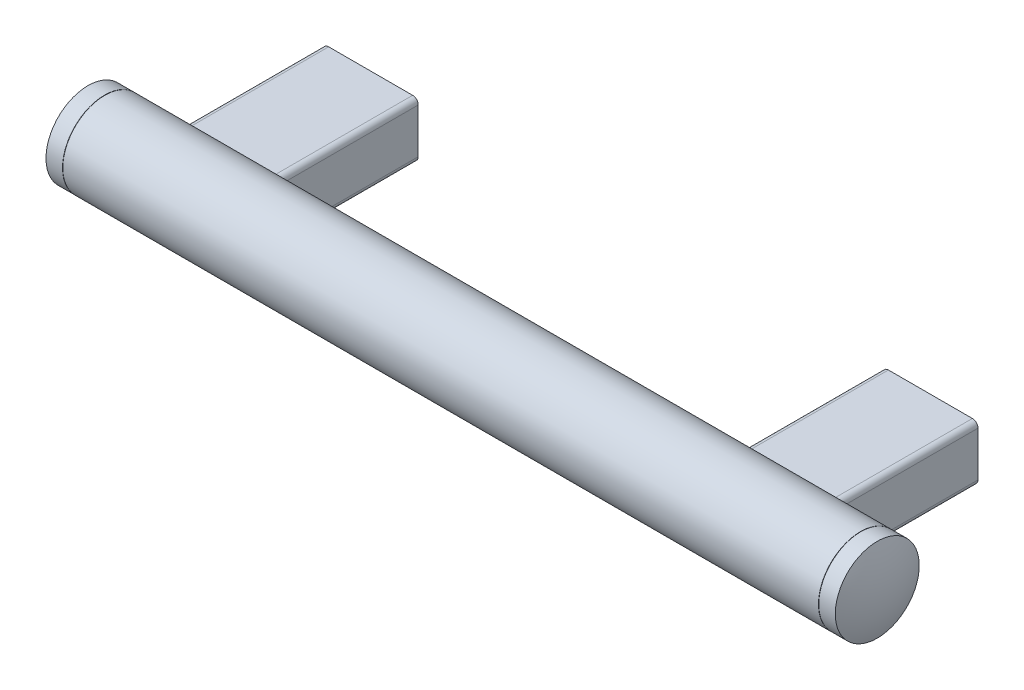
ISO-10303-21;
HEADER;
FILE_DESCRIPTION(('STEP AP214'),'2;1');
FILE_NAME('part.step','',(''),(''),'','','');
FILE_SCHEMA(('AUTOMOTIVE_DESIGN { 1 0 10303 214 1 1 1 1 }'));
ENDSEC;
DATA;
#1=APPLICATION_CONTEXT('core data for automotive mechanical design processes');
#2=APPLICATION_PROTOCOL_DEFINITION('international standard','automotive_design',2000,#1);
#3=PRODUCT_CONTEXT('',#1,'mechanical');
#4=PRODUCT('Part','Part','',(#3));
#5=PRODUCT_RELATED_PRODUCT_CATEGORY('part','',(#4));
#6=PRODUCT_DEFINITION_FORMATION('','',#4);
#7=PRODUCT_DEFINITION_CONTEXT('part definition',#1,'design');
#8=PRODUCT_DEFINITION('design','',#6,#7);
#9=PRODUCT_DEFINITION_SHAPE('','',#8);
#10=(LENGTH_UNIT() NAMED_UNIT(*) SI_UNIT(.MILLI.,.METRE.));
#11=(NAMED_UNIT(*) PLANE_ANGLE_UNIT() SI_UNIT($,.RADIAN.));
#12=(NAMED_UNIT(*) SI_UNIT($,.STERADIAN.) SOLID_ANGLE_UNIT());
#13=UNCERTAINTY_MEASURE_WITH_UNIT(LENGTH_MEASURE(1.E-05),#10,'distance_accuracy_value','');
#14=(GEOMETRIC_REPRESENTATION_CONTEXT(3) GLOBAL_UNCERTAINTY_ASSIGNED_CONTEXT((#13)) GLOBAL_UNIT_ASSIGNED_CONTEXT((#10,
#11,#12)) REPRESENTATION_CONTEXT('',''));
#15=CARTESIAN_POINT('',(0.,0.,0.));
#16=DIRECTION('',(0.,0.,1.));
#17=DIRECTION('',(1.,0.,0.));
#18=AXIS2_PLACEMENT_3D('',#15,#16,#17);
#19=CARTESIAN_POINT('',(205.,1.43150817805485E-12,60.));
#20=DIRECTION('',(-1.,0.,0.));
#21=DIRECTION('',(0.,0.,1.));
#22=AXIS2_PLACEMENT_3D('',#19,#20,#21);
#23=SPHERICAL_SURFACE('',#22,39.);
#24=CARTESIAN_POINT('',(241.,1.68289498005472E-12,60.));
#25=DIRECTION('',(-1.,0.,0.));
#26=DIRECTION('',(0.,-1.,0.));
#27=AXIS2_PLACEMENT_3D('',#24,#25,#26);
#28=CIRCLE('',#27,15.);
#29=CARTESIAN_POINT('',(241.,-14.9999999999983,60.));
#30=VERTEX_POINT('',#29);
#31=EDGE_CURVE('E455',#30,#30,#28,.T.);
#32=ORIENTED_EDGE('',*,*,#31,.F.);
#33=EDGE_LOOP('',(#32));
#34=FACE_BOUND('',#33,.T.);
#35=ADVANCED_FACE('F14',(#34),#23,.T.);
#36=CARTESIAN_POINT('',(235.,1.64099717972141E-12,60.));
#37=DIRECTION('',(-1.,0.,0.));
#38=DIRECTION('',(0.,-1.,0.));
#39=AXIS2_PLACEMENT_3D('',#36,#37,#38);
#40=CYLINDRICAL_SURFACE('',#39,15.);
#41=CARTESIAN_POINT('',(235.1,1.64169547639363E-12,60.));
#42=DIRECTION('',(1.,0.,0.));
#43=DIRECTION('',(0.,1.,0.));
#44=AXIS2_PLACEMENT_3D('',#41,#42,#43);
#45=CIRCLE('',#44,15.);
#46=CARTESIAN_POINT('',(235.1,15.0000000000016,60.));
#47=VERTEX_POINT('',#46);
#48=EDGE_CURVE('E9',#47,#47,#45,.T.);
#49=ORIENTED_EDGE('',*,*,#48,.T.);
#50=EDGE_LOOP('',(#49));
#51=FACE_BOUND('',#50,.T.);
#52=ORIENTED_EDGE('',*,*,#31,.T.);
#53=EDGE_LOOP('',(#52));
#54=FACE_BOUND('',#53,.T.);
#55=ADVANCED_FACE('F467',(#51,#54),#40,.T.);
#56=CARTESIAN_POINT('',(235.,1.64099717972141E-12,60.));
#57=DIRECTION('',(1.,0.,0.));
#58=DIRECTION('',(0.,1.,0.));
#59=AXIS2_PLACEMENT_3D('',#56,#57,#58);
#60=CONICAL_SURFACE('',#59,14.9,0.785398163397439);
#61=ORIENTED_EDGE('',*,*,#48,.F.);
#62=EDGE_LOOP('',(#61));
#63=FACE_BOUND('',#62,.T.);
#64=CARTESIAN_POINT('',(235.,1.64099717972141E-12,60.));
#65=DIRECTION('',(1.,0.,0.));
#66=DIRECTION('',(0.,1.,0.));
#67=AXIS2_PLACEMENT_3D('',#64,#65,#66);
#68=CIRCLE('',#67,14.9);
#69=CARTESIAN_POINT('',(235.,14.9000000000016,60.));
#70=VERTEX_POINT('',#69);
#71=EDGE_CURVE('E21',#70,#70,#68,.F.);
#72=ORIENTED_EDGE('',*,*,#71,.F.);
#73=EDGE_LOOP('',(#72));
#74=FACE_BOUND('',#73,.T.);
#75=ADVANCED_FACE('F464',(#63,#74),#60,.T.);
#76=CARTESIAN_POINT('',(0.,0.,17.));
#77=DIRECTION('',(0.,0.,-1.));
#78=DIRECTION('',(0.,1.,0.));
#79=AXIS2_PLACEMENT_3D('',#76,#77,#78);
#80=PLANE('',#79);
#81=CARTESIAN_POINT('',(0.,0.,17.));
#82=DIRECTION('',(0.,0.,-1.));
#83=DIRECTION('',(0.,1.,0.));
#84=AXIS2_PLACEMENT_3D('',#81,#82,#83);
#85=CIRCLE('',#84,3.);
#86=CARTESIAN_POINT('',(0.,3.,17.));
#87=VERTEX_POINT('',#86);
#88=EDGE_CURVE('E193',#87,#87,#85,.T.);
#89=ORIENTED_EDGE('',*,*,#88,.T.);
#90=EDGE_LOOP('',(#89));
#91=FACE_BOUND('',#90,.T.);
#92=ADVANCED_FACE('F466',(#91),#80,.T.);
#93=CARTESIAN_POINT('',(-5.,0.,60.));
#94=DIRECTION('',(1.,0.,0.));
#95=DIRECTION('',(0.,0.,1.));
#96=AXIS2_PLACEMENT_3D('',#93,#94,#95);
#97=SPHERICAL_SURFACE('',#96,39.);
#98=CARTESIAN_POINT('',(-41.,-2.69034686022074E-13,60.));
#99=DIRECTION('',(1.,0.,0.));
#100=DIRECTION('',(0.,1.,0.));
#101=AXIS2_PLACEMENT_3D('',#98,#99,#100);
#102=CIRCLE('',#101,15.);
#103=CARTESIAN_POINT('',(-41.0000000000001,14.9999999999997,60.));
#104=VERTEX_POINT('',#103);
#105=EDGE_CURVE('E445',#104,#104,#102,.T.);
#106=ORIENTED_EDGE('',*,*,#105,.F.);
#107=EDGE_LOOP('',(#106));
#108=FACE_BOUND('',#107,.T.);
#109=ADVANCED_FACE('F476',(#108),#97,.T.);
#110=CARTESIAN_POINT('',(200.,1.3976342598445E-12,17.));
#111=DIRECTION('',(0.,0.,-1.));
#112=DIRECTION('',(0.,1.,0.));
#113=AXIS2_PLACEMENT_3D('',#110,#111,#112);
#114=PLANE('',#113);
#115=CARTESIAN_POINT('',(200.,1.3976342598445E-12,17.));
#116=DIRECTION('',(0.,0.,-1.));
#117=DIRECTION('',(0.,1.,0.));
#118=AXIS2_PLACEMENT_3D('',#115,#116,#117);
#119=CIRCLE('',#118,3.);
#120=CARTESIAN_POINT('',(200.,3.0000000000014,17.));
#121=VERTEX_POINT('',#120);
#122=EDGE_CURVE('E807',#121,#121,#119,.T.);
#123=ORIENTED_EDGE('',*,*,#122,.T.);
#124=EDGE_LOOP('',(#123));
#125=FACE_BOUND('',#124,.T.);
#126=ADVANCED_FACE('F496',(#125),#114,.T.);
#127=CARTESIAN_POINT('',(0.,0.,17.));
#128=DIRECTION('',(0.,0.,-1.));
#129=DIRECTION('',(0.,1.,0.));
#130=AXIS2_PLACEMENT_3D('',#127,#128,#129);
#131=CYLINDRICAL_SURFACE('',#130,3.);
#132=ORIENTED_EDGE('',*,*,#88,.F.);
#133=EDGE_LOOP('',(#132));
#134=FACE_BOUND('',#133,.T.);
#135=CARTESIAN_POINT('',(0.,0.,0.));
#136=DIRECTION('',(0.,0.,-1.));
#137=DIRECTION('',(0.,1.,0.));
#138=AXIS2_PLACEMENT_3D('',#135,#136,#137);
#139=CIRCLE('',#138,3.);
#140=CARTESIAN_POINT('',(0.,3.,0.));
#141=VERTEX_POINT('',#140);
#142=EDGE_CURVE('E808',#141,#141,#139,.T.);
#143=ORIENTED_EDGE('',*,*,#142,.T.);
#144=EDGE_LOOP('',(#143));
#145=FACE_BOUND('',#144,.T.);
#146=ADVANCED_FACE('F480',(#134,#145),#131,.F.);
#147=CARTESIAN_POINT('',(-35.,-2.27871649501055E-13,60.));
#148=DIRECTION('',(1.,0.,0.));
#149=DIRECTION('',(0.,1.,0.));
#150=AXIS2_PLACEMENT_3D('',#147,#148,#149);
#151=CYLINDRICAL_SURFACE('',#150,15.);
#152=CARTESIAN_POINT('',(-35.1,-2.28557700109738E-13,60.));
#153=DIRECTION('',(-1.,0.,0.));
#154=DIRECTION('',(0.,-1.,0.));
#155=AXIS2_PLACEMENT_3D('',#152,#153,#154);
#156=CIRCLE('',#155,15.);
#157=CARTESIAN_POINT('',(-35.0999999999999,-15.0000000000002,60.));
#158=VERTEX_POINT('',#157);
#159=EDGE_CURVE('E452',#158,#158,#156,.T.);
#160=ORIENTED_EDGE('',*,*,#159,.T.);
#161=EDGE_LOOP('',(#160));
#162=FACE_BOUND('',#161,.T.);
#163=ORIENTED_EDGE('',*,*,#105,.T.);
#164=EDGE_LOOP('',(#163));
#165=FACE_BOUND('',#164,.T.);
#166=ADVANCED_FACE('F493',(#162,#165),#151,.T.);
#167=CARTESIAN_POINT('',(200.,1.3976342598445E-12,17.));
#168=DIRECTION('',(0.,0.,-1.));
#169=DIRECTION('',(0.,1.,0.));
#170=AXIS2_PLACEMENT_3D('',#167,#168,#169);
#171=CYLINDRICAL_SURFACE('',#170,3.);
#172=ORIENTED_EDGE('',*,*,#122,.F.);
#173=EDGE_LOOP('',(#172));
#174=FACE_BOUND('',#173,.T.);
#175=CARTESIAN_POINT('',(200.,1.39659334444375E-12,0.));
#176=DIRECTION('',(0.,0.,-1.));
#177=DIRECTION('',(0.,1.,0.));
#178=AXIS2_PLACEMENT_3D('',#175,#176,#177);
#179=CIRCLE('',#178,3.);
#180=CARTESIAN_POINT('',(200.,3.0000000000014,0.));
#181=VERTEX_POINT('',#180);
#182=EDGE_CURVE('E809',#181,#181,#179,.T.);
#183=ORIENTED_EDGE('',*,*,#182,.T.);
#184=EDGE_LOOP('',(#183));
#185=FACE_BOUND('',#184,.T.);
#186=ADVANCED_FACE('F479',(#174,#185),#171,.F.);
#187=CARTESIAN_POINT('',(15.,8.0000000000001,0.));
#188=DIRECTION('',(0.,0.,-1.));
#189=DIRECTION('',(1.,0.,0.));
#190=AXIS2_PLACEMENT_3D('',#187,#188,#189);
#191=PLANE('',#190);
#192=ORIENTED_EDGE('',*,*,#142,.F.);
#193=EDGE_LOOP('',(#192));
#194=FACE_BOUND('',#193,.T.);
#195=CARTESIAN_POINT('',(15.,8.0000000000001,0.));
#196=DIRECTION('',(0.,0.,-1.));
#197=DIRECTION('',(1.,0.,0.));
#198=AXIS2_PLACEMENT_3D('',#195,#196,#197);
#199=CIRCLE('',#198,2.);
#200=CARTESIAN_POINT('',(15.,10.,0.));
#201=VERTEX_POINT('',#200);
#202=CARTESIAN_POINT('',(17.,8.00000000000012,0.));
#203=VERTEX_POINT('',#202);
#204=EDGE_CURVE('E210',#201,#203,#199,.T.);
#205=ORIENTED_EDGE('',*,*,#204,.T.);
#206=DIRECTION('',(0.,-1.,0.));
#207=VECTOR('',#206,1.);
#208=CARTESIAN_POINT('',(17.,8.00000000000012,0.));
#209=LINE('',#208,#207);
#210=CARTESIAN_POINT('',(17.,-7.99999999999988,0.));
#211=VERTEX_POINT('',#210);
#212=EDGE_CURVE('E207',#203,#211,#209,.T.);
#213=ORIENTED_EDGE('',*,*,#212,.T.);
#214=CARTESIAN_POINT('',(15.,-7.9999999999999,0.));
#215=DIRECTION('',(0.,0.,-1.));
#216=DIRECTION('',(1.,0.,0.));
#217=AXIS2_PLACEMENT_3D('',#214,#215,#216);
#218=CIRCLE('',#217,2.);
#219=CARTESIAN_POINT('',(15.,-10.,0.));
#220=VERTEX_POINT('',#219);
#221=EDGE_CURVE('E204',#211,#220,#218,.T.);
#222=ORIENTED_EDGE('',*,*,#221,.T.);
#223=DIRECTION('',(-1.,0.,0.));
#224=VECTOR('',#223,1.);
#225=CARTESIAN_POINT('',(15.,-10.,0.));
#226=LINE('',#225,#224);
#227=CARTESIAN_POINT('',(-15.,-10.,0.));
#228=VERTEX_POINT('',#227);
#229=EDGE_CURVE('E201',#220,#228,#226,.T.);
#230=ORIENTED_EDGE('',*,*,#229,.T.);
#231=CARTESIAN_POINT('',(-15.,-8.0000000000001,0.));
#232=DIRECTION('',(0.,0.,-1.));
#233=DIRECTION('',(1.,0.,0.));
#234=AXIS2_PLACEMENT_3D('',#231,#232,#233);
#235=CIRCLE('',#234,2.);
#236=CARTESIAN_POINT('',(-17.,-8.00000000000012,0.));
#237=VERTEX_POINT('',#236);
#238=EDGE_CURVE('E198',#228,#237,#235,.T.);
#239=ORIENTED_EDGE('',*,*,#238,.T.);
#240=DIRECTION('',(0.,1.,0.));
#241=VECTOR('',#240,1.);
#242=CARTESIAN_POINT('',(-17.,-8.00000000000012,0.));
#243=LINE('',#242,#241);
#244=CARTESIAN_POINT('',(-17.,7.99999999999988,0.));
#245=VERTEX_POINT('',#244);
#246=EDGE_CURVE('E170',#237,#245,#243,.T.);
#247=ORIENTED_EDGE('',*,*,#246,.T.);
#248=CARTESIAN_POINT('',(-15.,7.9999999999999,0.));
#249=DIRECTION('',(0.,0.,-1.));
#250=DIRECTION('',(1.,0.,0.));
#251=AXIS2_PLACEMENT_3D('',#248,#249,#250);
#252=CIRCLE('',#251,2.);
#253=CARTESIAN_POINT('',(-15.,10.,0.));
#254=VERTEX_POINT('',#253);
#255=EDGE_CURVE('E164',#245,#254,#252,.T.);
#256=ORIENTED_EDGE('',*,*,#255,.T.);
#257=DIRECTION('',(1.,0.,0.));
#258=VECTOR('',#257,1.);
#259=CARTESIAN_POINT('',(-15.,10.,0.));
#260=LINE('',#259,#258);
#261=EDGE_CURVE('E167',#254,#201,#260,.T.);
#262=ORIENTED_EDGE('',*,*,#261,.T.);
#263=EDGE_LOOP('',(#205,#213,#222,#230,#239,#247,#256,#262));
#264=FACE_BOUND('',#263,.T.);
#265=ADVANCED_FACE('F166',(#194,#264),#191,.T.);
#266=CARTESIAN_POINT('',(-35.,-2.27871649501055E-13,60.));
#267=DIRECTION('',(-1.,0.,0.));
#268=DIRECTION('',(0.,-1.,0.));
#269=AXIS2_PLACEMENT_3D('',#266,#267,#268);
#270=CONICAL_SURFACE('',#269,14.9,0.785398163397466);
#271=ORIENTED_EDGE('',*,*,#159,.F.);
#272=EDGE_LOOP('',(#271));
#273=FACE_BOUND('',#272,.T.);
#274=CARTESIAN_POINT('',(-35.,-2.27871649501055E-13,60.));
#275=DIRECTION('',(-1.,0.,0.));
#276=DIRECTION('',(0.,-1.,0.));
#277=AXIS2_PLACEMENT_3D('',#274,#275,#276);
#278=CIRCLE('',#277,14.9);
#279=CARTESIAN_POINT('',(-34.9999999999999,-14.9000000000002,60.));
#280=VERTEX_POINT('',#279);
#281=EDGE_CURVE('E449',#280,#280,#278,.F.);
#282=ORIENTED_EDGE('',*,*,#281,.F.);
#283=EDGE_LOOP('',(#282));
#284=FACE_BOUND('',#283,.T.);
#285=ADVANCED_FACE('F485',(#273,#284),#270,.T.);
#286=CARTESIAN_POINT('',(215.,8.0000000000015,0.));
#287=DIRECTION('',(0.,0.,-1.));
#288=DIRECTION('',(1.,0.,0.));
#289=AXIS2_PLACEMENT_3D('',#286,#287,#288);
#290=PLANE('',#289);
#291=ORIENTED_EDGE('',*,*,#182,.F.);
#292=EDGE_LOOP('',(#291));
#293=FACE_BOUND('',#292,.T.);
#294=CARTESIAN_POINT('',(215.,8.0000000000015,0.));
#295=DIRECTION('',(0.,0.,-1.));
#296=DIRECTION('',(1.,0.,0.));
#297=AXIS2_PLACEMENT_3D('',#294,#295,#296);
#298=CIRCLE('',#297,2.);
#299=CARTESIAN_POINT('',(215.,10.0000000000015,0.));
#300=VERTEX_POINT('',#299);
#301=CARTESIAN_POINT('',(217.,8.00000000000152,0.));
#302=VERTEX_POINT('',#301);
#303=EDGE_CURVE('E216',#300,#302,#298,.T.);
#304=ORIENTED_EDGE('',*,*,#303,.T.);
#305=DIRECTION('',(0.,-1.,0.));
#306=VECTOR('',#305,1.);
#307=CARTESIAN_POINT('',(217.,8.00000000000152,0.));
#308=LINE('',#307,#306);
#309=CARTESIAN_POINT('',(217.,-7.99999999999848,0.));
#310=VERTEX_POINT('',#309);
#311=EDGE_CURVE('E254',#302,#310,#308,.T.);
#312=ORIENTED_EDGE('',*,*,#311,.T.);
#313=CARTESIAN_POINT('',(215.,-7.9999999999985,0.));
#314=DIRECTION('',(0.,0.,-1.));
#315=DIRECTION('',(1.,0.,0.));
#316=AXIS2_PLACEMENT_3D('',#313,#314,#315);
#317=CIRCLE('',#316,2.);
#318=CARTESIAN_POINT('',(215.,-9.9999999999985,0.));
#319=VERTEX_POINT('',#318);
#320=EDGE_CURVE('E251',#310,#319,#317,.T.);
#321=ORIENTED_EDGE('',*,*,#320,.T.);
#322=DIRECTION('',(-1.,0.,0.));
#323=VECTOR('',#322,1.);
#324=CARTESIAN_POINT('',(215.,-9.9999999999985,0.));
#325=LINE('',#324,#323);
#326=CARTESIAN_POINT('',(185.,-9.99999999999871,0.));
#327=VERTEX_POINT('',#326);
#328=EDGE_CURVE('E248',#319,#327,#325,.T.);
#329=ORIENTED_EDGE('',*,*,#328,.T.);
#330=CARTESIAN_POINT('',(185.,-7.99999999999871,0.));
#331=DIRECTION('',(0.,0.,-1.));
#332=DIRECTION('',(1.,0.,0.));
#333=AXIS2_PLACEMENT_3D('',#330,#331,#332);
#334=CIRCLE('',#333,2.);
#335=CARTESIAN_POINT('',(183.,-7.99999999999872,0.));
#336=VERTEX_POINT('',#335);
#337=EDGE_CURVE('E245',#327,#336,#334,.T.);
#338=ORIENTED_EDGE('',*,*,#337,.T.);
#339=DIRECTION('',(0.,1.,0.));
#340=VECTOR('',#339,1.);
#341=CARTESIAN_POINT('',(183.,-7.99999999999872,0.));
#342=LINE('',#341,#340);
#343=CARTESIAN_POINT('',(183.,8.00000000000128,0.));
#344=VERTEX_POINT('',#343);
#345=EDGE_CURVE('E242',#336,#344,#342,.T.);
#346=ORIENTED_EDGE('',*,*,#345,.T.);
#347=CARTESIAN_POINT('',(185.,8.00000000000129,0.));
#348=DIRECTION('',(0.,0.,-1.));
#349=DIRECTION('',(1.,0.,0.));
#350=AXIS2_PLACEMENT_3D('',#347,#348,#349);
#351=CIRCLE('',#350,2.);
#352=CARTESIAN_POINT('',(185.,10.0000000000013,0.));
#353=VERTEX_POINT('',#352);
#354=EDGE_CURVE('E239',#344,#353,#351,.T.);
#355=ORIENTED_EDGE('',*,*,#354,.T.);
#356=DIRECTION('',(1.,0.,0.));
#357=VECTOR('',#356,1.);
#358=CARTESIAN_POINT('',(185.,10.0000000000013,0.));
#359=LINE('',#358,#357);
#360=EDGE_CURVE('E235',#353,#300,#359,.T.);
#361=ORIENTED_EDGE('',*,*,#360,.T.);
#362=EDGE_LOOP('',(#304,#312,#321,#329,#338,#346,#355,#361));
#363=FACE_BOUND('',#362,.T.);
#364=ADVANCED_FACE('F428',(#293,#363),#290,.T.);
#365=CARTESIAN_POINT('',(15.,-7.9999999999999,0.));
#366=DIRECTION('',(0.,0.,1.));
#367=DIRECTION('',(-1.,0.,0.));
#368=AXIS2_PLACEMENT_3D('',#365,#366,#367);
#369=CYLINDRICAL_SURFACE('',#368,2.);
#370=CARTESIAN_POINT('',(13.,-7.99999999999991,47.3114224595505));
#371=CARTESIAN_POINT('',(13.0000023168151,-8.14386139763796,47.4021308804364));
#372=CARTESIAN_POINT('',(13.0155259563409,-8.28625788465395,47.4953643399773));
#373=CARTESIAN_POINT('',(13.0758229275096,-8.56371074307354,47.6837058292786));
#374=CARTESIAN_POINT('',(13.1206564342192,-8.69875139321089,47.7788173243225));
#375=CARTESIAN_POINT('',(13.2349554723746,-8.95003632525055,47.9617438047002));
#376=CARTESIAN_POINT('',(13.3028588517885,-9.06691465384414,48.0496641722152));
#377=CARTESIAN_POINT('',(13.4631357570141,-9.28706267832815,48.2199435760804));
#378=CARTESIAN_POINT('',(13.5554607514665,-9.39035876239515,48.3023132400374));
#379=CARTESIAN_POINT('',(13.7336841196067,-9.55123394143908,48.4336095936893));
#380=CARTESIAN_POINT('',(13.8135167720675,-9.6133331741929,48.4852566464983));
#381=CARTESIAN_POINT('',(13.9850088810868,-9.72635405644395,48.5805658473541));
#382=CARTESIAN_POINT('',(14.0766503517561,-9.77729239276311,48.624239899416));
#383=CARTESIAN_POINT('',(14.2529034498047,-9.85726234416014,48.6935123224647));
#384=CARTESIAN_POINT('',(14.3357376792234,-9.88859638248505,48.720955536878));
#385=CARTESIAN_POINT('',(14.507188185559,-9.94039558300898,48.766579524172));
#386=CARTESIAN_POINT('',(14.5958003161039,-9.96086844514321,48.7847668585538));
#387=CARTESIAN_POINT('',(14.7770635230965,-9.98966321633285,48.8104058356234));
#388=CARTESIAN_POINT('',(14.8697344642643,-9.9979163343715,48.8177966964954));
#389=CARTESIAN_POINT('',(15.0555138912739,-10.0013851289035,48.8208987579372));
#390=CARTESIAN_POINT('',(15.1486222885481,-9.99660333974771,48.8166122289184));
#391=CARTESIAN_POINT('',(15.3236977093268,-9.97542143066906,48.7977175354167));
#392=CARTESIAN_POINT('',(15.4059092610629,-9.96011451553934,48.7840808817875));
#393=CARTESIAN_POINT('',(15.5660895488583,-9.91999093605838,48.7485782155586));
#394=CARTESIAN_POINT('',(15.6440574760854,-9.89517246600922,48.7267106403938));
#395=CARTESIAN_POINT('',(15.7999821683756,-9.83508027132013,48.674237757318));
#396=CARTESIAN_POINT('',(15.8775130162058,-9.79916985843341,48.6431064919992));
#397=CARTESIAN_POINT('',(16.0253011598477,-9.71925283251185,48.5746377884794));
#398=CARTESIAN_POINT('',(16.0955525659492,-9.67523974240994,48.5372953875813));
#399=CARTESIAN_POINT('',(16.2620749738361,-9.55636990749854,48.4378021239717));
#400=CARTESIAN_POINT('',(16.353495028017,-9.47718432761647,48.3726678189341));
#401=CARTESIAN_POINT('',(16.518627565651,-9.30686163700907,48.2358889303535));
#402=CARTESIAN_POINT('',(16.5923103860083,-9.21570489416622,48.1642337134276));
#403=CARTESIAN_POINT('',(16.7227715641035,-9.02265032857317,48.0163959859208));
#404=CARTESIAN_POINT('',(16.7792895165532,-8.9206160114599,47.940162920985));
#405=CARTESIAN_POINT('',(16.8736458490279,-8.70912728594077,47.7865564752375));
#406=CARTESIAN_POINT('',(16.9114866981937,-8.5996738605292,47.7091832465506));
#407=CARTESIAN_POINT('',(16.9722292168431,-8.35796248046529,47.543311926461));
#408=CARTESIAN_POINT('',(16.9919212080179,-8.22479320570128,47.4549411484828));
#409=CARTESIAN_POINT('',(17.0040509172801,-7.95466925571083,47.2819435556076));
#410=CARTESIAN_POINT('',(16.9964773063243,-7.81771303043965,47.1973183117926));
#411=CARTESIAN_POINT('',(16.9529013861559,-7.5479211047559,47.0364770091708));
#412=CARTESIAN_POINT('',(16.9176078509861,-7.4150673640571,46.960104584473));
#413=CARTESIAN_POINT('',(16.8182830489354,-7.15555538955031,46.8159187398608));
#414=CARTESIAN_POINT('',(16.7542827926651,-7.02889063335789,46.7480961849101));
#415=CARTESIAN_POINT('',(16.6077870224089,-6.80389422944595,46.631341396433));
#416=CARTESIAN_POINT('',(16.5287203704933,-6.70401274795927,46.5811018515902));
#417=CARTESIAN_POINT('',(16.3502883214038,-6.51906286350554,46.4902837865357));
#418=CARTESIAN_POINT('',(16.2509443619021,-6.43397899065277,46.449695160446));
#419=CARTESIAN_POINT('',(16.0496639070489,-6.29378739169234,46.3840743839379));
#420=CARTESIAN_POINT('',(15.9499072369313,-6.23617899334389,46.3576788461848));
#421=CARTESIAN_POINT('',(15.7404007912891,-6.13851290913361,46.3134536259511));
#422=CARTESIAN_POINT('',(15.6306571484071,-6.09844453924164,46.2956187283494));
#423=CARTESIAN_POINT('',(15.4147576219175,-6.04056991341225,46.2700171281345));
#424=CARTESIAN_POINT('',(15.3091262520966,-6.0211242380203,46.2615068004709));
#425=CARTESIAN_POINT('',(15.0957874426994,-5.99942292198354,46.2520156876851));
#426=CARTESIAN_POINT('',(14.9880805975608,-5.99716243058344,46.2510327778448));
#427=CARTESIAN_POINT('',(14.7777746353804,-6.00969461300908,46.2565067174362));
#428=CARTESIAN_POINT('',(14.6751312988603,-6.02387585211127,46.2626968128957));
#429=CARTESIAN_POINT('',(14.4738867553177,-6.06769355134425,46.281994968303));
#430=CARTESIAN_POINT('',(14.3752853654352,-6.09732931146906,46.2951027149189));
#431=CARTESIAN_POINT('',(14.1842523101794,-6.1710398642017,46.3281349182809));
#432=CARTESIAN_POINT('',(14.0918564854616,-6.21519107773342,46.3480954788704));
#433=CARTESIAN_POINT('',(13.9160688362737,-6.3161436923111,46.3945082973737));
#434=CARTESIAN_POINT('',(13.8326780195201,-6.37294650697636,46.4209612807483));
#435=CARTESIAN_POINT('',(13.6732429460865,-6.49982014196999,46.481218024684));
#436=CARTESIAN_POINT('',(13.5976745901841,-6.57035979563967,46.5152909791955));
#437=CARTESIAN_POINT('',(13.4595254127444,-6.72041002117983,46.5894410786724));
#438=CARTESIAN_POINT('',(13.3969495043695,-6.79992396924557,46.6295204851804));
#439=CARTESIAN_POINT('',(13.2808729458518,-6.97225102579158,46.7185142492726));
#440=CARTESIAN_POINT('',(13.2285510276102,-7.06562015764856,46.7678851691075));
#441=CARTESIAN_POINT('',(13.1401606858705,-7.25695759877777,46.8718461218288));
#442=CARTESIAN_POINT('',(13.1040923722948,-7.35492593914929,46.9264361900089));
#443=CARTESIAN_POINT('',(13.0503538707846,-7.54425766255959,47.0348536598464));
#444=CARTESIAN_POINT('',(13.0313508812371,-7.63544968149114,47.08833048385));
#445=CARTESIAN_POINT('',(13.0061708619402,-7.81795534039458,47.1980102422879));
#446=CARTESIAN_POINT('',(12.9999985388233,-7.90926901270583,47.2542141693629));
#447=CARTESIAN_POINT('',(13.,-7.99999999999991,47.3114224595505));
#448=B_SPLINE_CURVE_WITH_KNOTS('',3,(#370,#371,#372,#373,#374,#375,#376,#377,#378,#379,#380,
#381,#382,#383,#384,#385,#386,#387,#388,#389,#390,#391,#392,#393,#394,#395,#396,#397,#398,#399,
#400,#401,#402,#403,#404,#405,#406,#407,#408,#409,#410,#411,#412,#413,#414,#415,#416,#417,#418,
#419,#420,#421,#422,#423,#424,#425,#426,#427,#428,#429,#430,#431,#432,#433,#434,#435,#436,#437,
#438,#439,#440,#441,#442,#443,#444,#445,#446,#447),.UNSPECIFIED.,.T.,.F.,(4,2,2,2,2,2,2,2,2,2,2,
2,2,2,2,2,2,2,2,2,2,2,2,2,2,2,2,2,2,2,2,2,2,2,2,2,2,2,4),(0.,0.50977099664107,1.02059188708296,
1.50208208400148,1.98262254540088,2.32213593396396,2.66113819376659,2.93816857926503,
3.21500230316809,3.4933886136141,3.77172080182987,4.02480636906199,4.27794000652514,
4.54976470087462,4.82180763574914,5.23168501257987,5.6422431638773,6.05875006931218,
6.47520189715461,6.95596901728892,7.43693592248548,7.90599013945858,8.37453887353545,
8.78294034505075,9.19091226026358,9.54354102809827,9.89595470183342,10.2175724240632,
10.5390993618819,10.8490427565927,11.1589721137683,11.4705600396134,11.7821827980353,
12.1073297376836,12.4325994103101,12.7847727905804,13.1369485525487,13.4583347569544,
13.7798388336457),.UNSPECIFIED.);
#449=CARTESIAN_POINT('',(15.,-10.,48.819660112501));
#450=VERTEX_POINT('',#449);
#451=CARTESIAN_POINT('',(17.,-7.99999999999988,47.3114224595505));
#452=VERTEX_POINT('',#451);
#453=EDGE_CURVE('E415',#450,#452,#448,.T.);
#454=ORIENTED_EDGE('',*,*,#453,.F.);
#455=DIRECTION('',(0.,0.,1.));
#456=VECTOR('',#455,1.);
#457=CARTESIAN_POINT('',(15.,-10.,0.));
#458=LINE('',#457,#456);
#459=EDGE_CURVE('E221',#220,#450,#458,.T.);
#460=ORIENTED_EDGE('',*,*,#459,.F.);
#461=ORIENTED_EDGE('',*,*,#221,.F.);
#462=DIRECTION('',(0.,0.,1.));
#463=VECTOR('',#462,1.);
#464=CARTESIAN_POINT('',(17.,-7.99999999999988,0.));
#465=LINE('',#464,#463);
#466=EDGE_CURVE('E217',#211,#452,#465,.T.);
#467=ORIENTED_EDGE('',*,*,#466,.T.);
#468=EDGE_LOOP('',(#454,#460,#461,#467));
#469=FACE_BOUND('',#468,.T.);
#470=ADVANCED_FACE('F424',(#469),#369,.T.);
#471=CARTESIAN_POINT('',(15.,-10.,0.));
#472=DIRECTION('',(0.,1.,0.));
#473=DIRECTION('',(1.,0.,0.));
#474=AXIS2_PLACEMENT_3D('',#471,#472,#473);
#475=PLANE('',#474);
#476=DIRECTION('',(1.,0.,0.));
#477=VECTOR('',#476,1.);
#478=CARTESIAN_POINT('',(-35.,-10.0000000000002,48.819660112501));
#479=LINE('',#478,#477);
#480=CARTESIAN_POINT('',(-15.,-10.,48.8196601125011));
#481=VERTEX_POINT('',#480);
#482=EDGE_CURVE('E411',#481,#450,#479,.T.);
#483=ORIENTED_EDGE('',*,*,#482,.F.);
#484=DIRECTION('',(0.,0.,1.));
#485=VECTOR('',#484,1.);
#486=CARTESIAN_POINT('',(-15.,-10.,0.));
#487=LINE('',#486,#485);
#488=EDGE_CURVE('E225',#228,#481,#487,.T.);
#489=ORIENTED_EDGE('',*,*,#488,.F.);
#490=ORIENTED_EDGE('',*,*,#229,.F.);
#491=ORIENTED_EDGE('',*,*,#459,.T.);
#492=EDGE_LOOP('',(#483,#489,#490,#491));
#493=FACE_BOUND('',#492,.T.);
#494=ADVANCED_FACE('F401',(#493),#475,.F.);
#495=CARTESIAN_POINT('',(-15.,-8.0000000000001,0.));
#496=DIRECTION('',(0.,0.,1.));
#497=DIRECTION('',(-1.,0.,0.));
#498=AXIS2_PLACEMENT_3D('',#495,#496,#497);
#499=CYLINDRICAL_SURFACE('',#498,2.);
#500=CARTESIAN_POINT('',(-17.,-8.00000000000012,47.3114224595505));
#501=CARTESIAN_POINT('',(-16.9999976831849,-8.14386139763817,47.4021308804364));
#502=CARTESIAN_POINT('',(-16.9844740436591,-8.28625788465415,47.4953643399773));
#503=CARTESIAN_POINT('',(-16.9241770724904,-8.56371074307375,47.6837058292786));
#504=CARTESIAN_POINT('',(-16.8793435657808,-8.69875139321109,47.7788173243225));
#505=CARTESIAN_POINT('',(-16.7650445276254,-8.95003632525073,47.9617438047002));
#506=CARTESIAN_POINT('',(-16.6971411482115,-9.06691465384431,48.0496641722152));
#507=CARTESIAN_POINT('',(-16.5368642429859,-9.28706267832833,48.2199435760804));
#508=CARTESIAN_POINT('',(-16.4445392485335,-9.39035876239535,48.3023132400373));
#509=CARTESIAN_POINT('',(-16.2663158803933,-9.55123394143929,48.4336095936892));
#510=CARTESIAN_POINT('',(-16.1864832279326,-9.61333317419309,48.4852566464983));
#511=CARTESIAN_POINT('',(-16.0149911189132,-9.72635405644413,48.5805658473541));
#512=CARTESIAN_POINT('',(-15.9233496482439,-9.77729239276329,48.624239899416));
#513=CARTESIAN_POINT('',(-15.7470965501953,-9.85726234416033,48.6935123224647));
#514=CARTESIAN_POINT('',(-15.6642623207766,-9.88859638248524,48.720955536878));
#515=CARTESIAN_POINT('',(-15.492811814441,-9.94039558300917,48.7665795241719));
#516=CARTESIAN_POINT('',(-15.4041996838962,-9.96086844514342,48.7847668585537));
#517=CARTESIAN_POINT('',(-15.2229364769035,-9.98966321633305,48.8104058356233));
#518=CARTESIAN_POINT('',(-15.1302655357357,-9.9979163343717,48.8177966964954));
#519=CARTESIAN_POINT('',(-14.9444861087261,-10.0013851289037,48.8208987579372));
#520=CARTESIAN_POINT('',(-14.8513777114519,-9.99660333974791,48.8166122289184));
#521=CARTESIAN_POINT('',(-14.6763022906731,-9.97542143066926,48.7977175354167));
#522=CARTESIAN_POINT('',(-14.5940907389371,-9.96011451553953,48.7840808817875));
#523=CARTESIAN_POINT('',(-14.4339104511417,-9.91999093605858,48.7485782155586));
#524=CARTESIAN_POINT('',(-14.3559425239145,-9.89517246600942,48.7267106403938));
#525=CARTESIAN_POINT('',(-14.2000178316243,-9.83508027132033,48.674237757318));
#526=CARTESIAN_POINT('',(-14.1224869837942,-9.7991698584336,48.6431064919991));
#527=CARTESIAN_POINT('',(-13.9746988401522,-9.71925283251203,48.5746377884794));
#528=CARTESIAN_POINT('',(-13.9044474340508,-9.67523974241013,48.5372953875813));
#529=CARTESIAN_POINT('',(-13.7379250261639,-9.55636990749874,48.4378021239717));
#530=CARTESIAN_POINT('',(-13.646504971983,-9.47718432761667,48.3726678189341));
#531=CARTESIAN_POINT('',(-13.481372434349,-9.30686163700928,48.2358889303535));
#532=CARTESIAN_POINT('',(-13.4076896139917,-9.21570489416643,48.1642337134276));
#533=CARTESIAN_POINT('',(-13.2772284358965,-9.02265032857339,48.0163959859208));
#534=CARTESIAN_POINT('',(-13.2207104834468,-8.92061601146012,47.9401629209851));
#535=CARTESIAN_POINT('',(-13.1263541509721,-8.70912728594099,47.7865564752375));
#536=CARTESIAN_POINT('',(-13.0885133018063,-8.59967386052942,47.7091832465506));
#537=CARTESIAN_POINT('',(-13.0277707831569,-8.35796248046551,47.543311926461));
#538=CARTESIAN_POINT('',(-13.0080787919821,-8.2247932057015,47.4549411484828));
#539=CARTESIAN_POINT('',(-12.9959490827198,-7.95466925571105,47.2819435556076));
#540=CARTESIAN_POINT('',(-13.0035226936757,-7.81771303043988,47.1973183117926));
#541=CARTESIAN_POINT('',(-13.0470986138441,-7.54792110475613,47.0364770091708));
#542=CARTESIAN_POINT('',(-13.0823921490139,-7.41506736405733,46.960104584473));
#543=CARTESIAN_POINT('',(-13.1817169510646,-7.15555538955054,46.8159187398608));
#544=CARTESIAN_POINT('',(-13.2457172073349,-7.02889063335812,46.7480961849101));
#545=CARTESIAN_POINT('',(-13.392212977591,-6.80389422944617,46.631341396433));
#546=CARTESIAN_POINT('',(-13.4712796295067,-6.70401274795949,46.5811018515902));
#547=CARTESIAN_POINT('',(-13.6497116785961,-6.51906286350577,46.4902837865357));
#548=CARTESIAN_POINT('',(-13.7490556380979,-6.433978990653,46.449695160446));
#549=CARTESIAN_POINT('',(-13.950336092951,-6.29378739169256,46.3840743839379));
#550=CARTESIAN_POINT('',(-14.0500927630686,-6.23617899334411,46.3576788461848));
#551=CARTESIAN_POINT('',(-14.2595992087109,-6.13851290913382,46.3134536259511));
#552=CARTESIAN_POINT('',(-14.3693428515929,-6.09844453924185,46.2956187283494));
#553=CARTESIAN_POINT('',(-14.5852423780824,-6.04056991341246,46.2700171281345));
#554=CARTESIAN_POINT('',(-14.6908737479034,-6.02112423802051,46.2615068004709));
#555=CARTESIAN_POINT('',(-14.9042125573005,-5.99942292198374,46.2520156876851));
#556=CARTESIAN_POINT('',(-15.0119194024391,-5.99716243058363,46.2510327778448));
#557=CARTESIAN_POINT('',(-15.2222253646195,-6.00969461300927,46.2565067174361));
#558=CARTESIAN_POINT('',(-15.3248687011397,-6.02387585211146,46.2626968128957));
#559=CARTESIAN_POINT('',(-15.5261132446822,-6.06769355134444,46.281994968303));
#560=CARTESIAN_POINT('',(-15.6247146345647,-6.09732931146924,46.2951027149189));
#561=CARTESIAN_POINT('',(-15.8157476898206,-6.17103986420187,46.3281349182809));
#562=CARTESIAN_POINT('',(-15.9081435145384,-6.21519107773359,46.3480954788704));
#563=CARTESIAN_POINT('',(-16.0839311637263,-6.31614369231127,46.3945082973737));
#564=CARTESIAN_POINT('',(-16.1673219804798,-6.37294650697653,46.4209612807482));
#565=CARTESIAN_POINT('',(-16.3267570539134,-6.49982014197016,46.4812180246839));
#566=CARTESIAN_POINT('',(-16.4023254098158,-6.57035979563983,46.5152909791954));
#567=CARTESIAN_POINT('',(-16.5404745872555,-6.72041002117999,46.5894410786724));
#568=CARTESIAN_POINT('',(-16.6030504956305,-6.79992396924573,46.6295204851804));
#569=CARTESIAN_POINT('',(-16.7191270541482,-6.97225102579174,46.7185142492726));
#570=CARTESIAN_POINT('',(-16.7714489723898,-7.06562015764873,46.7678851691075));
#571=CARTESIAN_POINT('',(-16.8598393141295,-7.25695759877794,46.8718461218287));
#572=CARTESIAN_POINT('',(-16.8959076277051,-7.35492593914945,46.9264361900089));
#573=CARTESIAN_POINT('',(-16.9496461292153,-7.54425766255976,47.0348536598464));
#574=CARTESIAN_POINT('',(-16.9686491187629,-7.63544968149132,47.08833048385));
#575=CARTESIAN_POINT('',(-16.9938291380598,-7.81795534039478,47.1980102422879));
#576=CARTESIAN_POINT('',(-17.0000014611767,-7.90926901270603,47.2542141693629));
#577=CARTESIAN_POINT('',(-17.,-8.00000000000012,47.3114224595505));
#578=B_SPLINE_CURVE_WITH_KNOTS('',3,(#500,#501,#502,#503,#504,#505,#506,#507,#508,#509,#510,
#511,#512,#513,#514,#515,#516,#517,#518,#519,#520,#521,#522,#523,#524,#525,#526,#527,#528,#529,
#530,#531,#532,#533,#534,#535,#536,#537,#538,#539,#540,#541,#542,#543,#544,#545,#546,#547,#548,
#549,#550,#551,#552,#553,#554,#555,#556,#557,#558,#559,#560,#561,#562,#563,#564,#565,#566,#567,
#568,#569,#570,#571,#572,#573,#574,#575,#576,#577),.UNSPECIFIED.,.T.,.F.,(4,2,2,2,2,2,2,2,2,2,2,
2,2,2,2,2,2,2,2,2,2,2,2,2,2,2,2,2,2,2,2,2,2,2,2,2,2,2,4),(0.,0.509770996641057,1.02059188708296,
1.50208208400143,1.98262254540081,2.32213593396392,2.66113819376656,2.93816857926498,
3.21500230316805,3.49338861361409,3.77172080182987,4.024806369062,4.27794000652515,
4.54976470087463,4.82180763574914,5.23168501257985,5.64224316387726,6.05875006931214,
6.47520189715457,6.95596901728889,7.43693592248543,7.90599013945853,8.37453887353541,
8.78294034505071,9.19091226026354,9.54354102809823,9.89595470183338,10.2175724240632,
10.5390993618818,10.8490427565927,11.1589721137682,11.4705600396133,11.7821827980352,
12.1073297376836,12.4325994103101,12.7847727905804,13.1369485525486,13.4583347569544,
13.7798388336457),.UNSPECIFIED.);
#579=CARTESIAN_POINT('',(-17.,-8.00000000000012,47.3114224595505));
#580=VERTEX_POINT('',#579);
#581=EDGE_CURVE('E404',#580,#481,#578,.T.);
#582=ORIENTED_EDGE('',*,*,#581,.F.);
#583=DIRECTION('',(0.,0.,1.));
#584=VECTOR('',#583,1.);
#585=CARTESIAN_POINT('',(-17.,-8.00000000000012,0.));
#586=LINE('',#585,#584);
#587=EDGE_CURVE('E229',#237,#580,#586,.T.);
#588=ORIENTED_EDGE('',*,*,#587,.F.);
#589=ORIENTED_EDGE('',*,*,#238,.F.);
#590=ORIENTED_EDGE('',*,*,#488,.T.);
#591=EDGE_LOOP('',(#582,#588,#589,#590));
#592=FACE_BOUND('',#591,.T.);
#593=ADVANCED_FACE('F396',(#592),#499,.T.);
#594=CARTESIAN_POINT('',(-17.,-8.00000000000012,0.));
#595=DIRECTION('',(1.,0.,0.));
#596=DIRECTION('',(0.,0.,1.));
#597=AXIS2_PLACEMENT_3D('',#594,#595,#596);
#598=PLANE('',#597);
#599=CARTESIAN_POINT('',(-17.,-1.18710434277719E-13,60.));
#600=DIRECTION('',(1.,0.,0.));
#601=DIRECTION('',(0.,0.,1.));
#602=AXIS2_PLACEMENT_3D('',#599,#600,#601);
#603=CIRCLE('',#602,15.);
#604=CARTESIAN_POINT('',(-17.,7.99999999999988,47.3114224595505));
#605=VERTEX_POINT('',#604);
#606=EDGE_CURVE('E386',#605,#580,#603,.F.);
#607=ORIENTED_EDGE('',*,*,#606,.F.);
#608=DIRECTION('',(0.,0.,1.));
#609=VECTOR('',#608,1.);
#610=CARTESIAN_POINT('',(-17.,7.99999999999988,0.));
#611=LINE('',#610,#609);
#612=EDGE_CURVE('E181',#245,#605,#611,.T.);
#613=ORIENTED_EDGE('',*,*,#612,.F.);
#614=ORIENTED_EDGE('',*,*,#246,.F.);
#615=ORIENTED_EDGE('',*,*,#587,.T.);
#616=EDGE_LOOP('',(#607,#613,#614,#615));
#617=FACE_BOUND('',#616,.T.);
#618=ADVANCED_FACE('F392',(#617),#598,.F.);
#619=CARTESIAN_POINT('',(-15.,7.9999999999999,0.));
#620=DIRECTION('',(0.,0.,1.));
#621=DIRECTION('',(-1.,0.,0.));
#622=AXIS2_PLACEMENT_3D('',#619,#620,#621);
#623=CYLINDRICAL_SURFACE('',#622,2.);
#624=CARTESIAN_POINT('',(-17.,7.99999999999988,47.3114224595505));
#625=CARTESIAN_POINT('',(-16.9999991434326,7.87909476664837,47.2351918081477));
#626=CARTESIAN_POINT('',(-16.9890388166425,7.75708923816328,47.1607041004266));
#627=CARTESIAN_POINT('',(-16.944013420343,7.51414460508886,47.0170299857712));
#628=CARTESIAN_POINT('',(-16.909954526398,7.39320522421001,46.9478421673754));
#629=CARTESIAN_POINT('',(-16.8175938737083,7.15580080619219,46.8161820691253));
#630=CARTESIAN_POINT('',(-16.7591388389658,7.03936923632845,46.7537554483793));
#631=CARTESIAN_POINT('',(-16.6180104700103,6.81706769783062,46.6379910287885));
#632=CARTESIAN_POINT('',(-16.5353548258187,6.71119009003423,46.5846466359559));
#633=CARTESIAN_POINT('',(-16.3589136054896,6.52774525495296,46.4945296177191));
#634=CARTESIAN_POINT('',(-16.2677073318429,6.44830074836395,46.4565302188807));
#635=CARTESIAN_POINT('',(-16.0701948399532,6.30605393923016,46.3897143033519));
#636=CARTESIAN_POINT('',(-15.9639012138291,6.24323788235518,46.3608901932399));
#637=CARTESIAN_POINT('',(-15.7525224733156,6.14371866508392,46.3157983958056));
#638=CARTESIAN_POINT('',(-15.6486727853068,6.10485920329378,46.298476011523));
#639=CARTESIAN_POINT('',(-15.4350253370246,6.04473842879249,46.2718452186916));
#640=CARTESIAN_POINT('',(-15.3252301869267,6.02346945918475,46.2625333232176));
#641=CARTESIAN_POINT('',(-15.1101174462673,6.00028628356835,46.2523925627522));
#642=CARTESIAN_POINT('',(-15.0049409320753,5.99726003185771,46.2510762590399));
#643=CARTESIAN_POINT('',(-14.795579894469,6.00771705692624,46.2556422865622));
#644=CARTESIAN_POINT('',(-14.6913952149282,6.02119769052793,46.2615234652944));
#645=CARTESIAN_POINT('',(-14.4886277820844,6.06374928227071,46.2802526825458));
#646=CARTESIAN_POINT('',(-14.3899832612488,6.09257556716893,46.2929914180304));
#647=CARTESIAN_POINT('',(-14.1992155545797,6.16447906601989,46.3251786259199));
#648=CARTESIAN_POINT('',(-14.1070926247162,6.20755683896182,46.3446273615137));
#649=CARTESIAN_POINT('',(-13.9295504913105,6.30744168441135,46.3904718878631));
#650=CARTESIAN_POINT('',(-13.8443382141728,6.36454602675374,46.417019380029));
#651=CARTESIAN_POINT('',(-13.6849200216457,6.48975291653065,46.4763947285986));
#652=CARTESIAN_POINT('',(-13.6107163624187,6.55785771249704,46.5092238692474));
#653=CARTESIAN_POINT('',(-13.4703450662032,6.7072135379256,46.5828236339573));
#654=CARTESIAN_POINT('',(-13.4049591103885,6.78901734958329,46.6239600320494));
#655=CARTESIAN_POINT('',(-13.288789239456,6.95960528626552,46.7119184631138));
#656=CARTESIAN_POINT('',(-13.2380106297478,7.04839193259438,46.7587425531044));
#657=CARTESIAN_POINT('',(-13.146904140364,7.23951560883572,46.8621785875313));
#658=CARTESIAN_POINT('',(-13.1081365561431,7.34231828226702,46.9193012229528));
#659=CARTESIAN_POINT('',(-13.0482089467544,7.55028832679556,47.0382283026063));
#660=CARTESIAN_POINT('',(-13.0270567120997,7.65545672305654,47.1000348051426));
#661=CARTESIAN_POINT('',(-13.0000866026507,7.87914859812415,47.2352758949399));
#662=CARTESIAN_POINT('',(-12.9965732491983,7.9976616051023,47.309187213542));
#663=CARTESIAN_POINT('',(-13.0100119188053,8.23176813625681,47.459768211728));
#664=CARTESIAN_POINT('',(-13.026978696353,8.34735949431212,47.5364398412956));
#665=CARTESIAN_POINT('',(-13.0835973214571,8.5867568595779,47.6999585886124));
#666=CARTESIAN_POINT('',(-13.1257113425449,8.70990049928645,47.786929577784));
#667=CARTESIAN_POINT('',(-13.2334577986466,8.9467076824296,47.9593245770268));
#668=CARTESIAN_POINT('',(-13.2990930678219,9.06037008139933,48.0447483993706));
#669=CARTESIAN_POINT('',(-13.4423655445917,9.25960123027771,48.1985889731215));
#670=CARTESIAN_POINT('',(-13.5169227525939,9.34685994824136,48.2676856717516));
#671=CARTESIAN_POINT('',(-13.6829377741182,9.50957472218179,48.3991861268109));
#672=CARTESIAN_POINT('',(-13.7743716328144,9.58504723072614,48.4615991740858));
#673=CARTESIAN_POINT('',(-13.9509067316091,9.70530243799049,48.5627005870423));
#674=CARTESIAN_POINT('',(-14.0326722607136,9.75315622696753,48.603550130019));
#675=CARTESIAN_POINT('',(-14.2053049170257,9.83784302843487,48.6765742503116));
#676=CARTESIAN_POINT('',(-14.296160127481,9.87469022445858,48.7087599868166));
#677=CARTESIAN_POINT('',(-14.4712701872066,9.9306990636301,48.758007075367));
#678=CARTESIAN_POINT('',(-14.554509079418,9.95167197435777,48.7766025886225));
#679=CARTESIAN_POINT('',(-14.7245244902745,9.98281750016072,48.8042955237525));
#680=CARTESIAN_POINT('',(-14.8112988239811,9.99299668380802,48.8133987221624));
#681=CARTESIAN_POINT('',(-14.9861247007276,10.0018703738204,48.8213315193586));
#682=CARTESIAN_POINT('',(-15.0741788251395,10.0005370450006,48.8201362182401));
#683=CARTESIAN_POINT('',(-15.2486141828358,9.98641726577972,48.8075224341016));
#684=CARTESIAN_POINT('',(-15.3349950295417,9.97362820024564,48.7961016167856));
#685=CARTESIAN_POINT('',(-15.5009447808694,9.93804813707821,48.7645323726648));
#686=CARTESIAN_POINT('',(-15.5806434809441,9.91559258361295,48.7446769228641));
#687=CARTESIAN_POINT('',(-15.7347280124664,9.86194601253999,48.6976421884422));
#688=CARTESIAN_POINT('',(-15.8091112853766,9.83075082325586,48.6704594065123));
#689=CARTESIAN_POINT('',(-15.9806238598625,9.74666189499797,48.5979492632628));
#690=CARTESIAN_POINT('',(-16.0747398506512,9.69009939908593,48.5497345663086));
#691=CARTESIAN_POINT('',(-16.2497262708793,9.56518206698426,48.4451760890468));
#692=CARTESIAN_POINT('',(-16.3305694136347,9.49680351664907,48.3888159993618));
#693=CARTESIAN_POINT('',(-16.497930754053,9.331678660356,48.2554817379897));
#694=CARTESIAN_POINT('',(-16.5804869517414,9.23217372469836,48.1769512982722));
#695=CARTESIAN_POINT('',(-16.7240153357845,9.02177052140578,48.0156229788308));
#696=CARTESIAN_POINT('',(-16.7849693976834,8.9108627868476,47.932821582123));
#697=CARTESIAN_POINT('',(-16.8890292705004,8.67085776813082,47.7590885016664));
#698=CARTESIAN_POINT('',(-16.9302441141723,8.54101472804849,47.6680503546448));
#699=CARTESIAN_POINT('',(-16.9857218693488,8.27458961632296,47.4877259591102));
#700=CARTESIAN_POINT('',(-17.0000009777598,8.13801164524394,47.3984386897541));
#701=CARTESIAN_POINT('',(-17.,7.99999999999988,47.3114224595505));
#702=B_SPLINE_CURVE_WITH_KNOTS('',3,(#624,#625,#626,#627,#628,#629,#630,#631,#632,#633,#634,
#635,#636,#637,#638,#639,#640,#641,#642,#643,#644,#645,#646,#647,#648,#649,#650,#651,#652,#653,
#654,#655,#656,#657,#658,#659,#660,#661,#662,#663,#664,#665,#666,#667,#668,#669,#670,#671,#672,
#673,#674,#675,#676,#677,#678,#679,#680,#681,#682,#683,#684,#685,#686,#687,#688,#689,#690,#691,
#692,#693,#694,#695,#696,#697,#698,#699,#700,#701),.UNSPECIFIED.,.T.,.F.,(4,2,2,2,2,2,2,2,2,2,2,
2,2,2,2,2,2,2,2,2,2,2,2,2,2,2,2,2,2,2,2,2,2,2,2,2,2,2,4),(0.,0.428302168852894,
0.856489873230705,1.28740928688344,1.71801449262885,2.09620696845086,2.47408563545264,
2.80902084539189,3.14381018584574,3.45796652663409,3.77207256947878,4.08131419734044,
4.39056795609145,4.70704747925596,5.02359177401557,5.35972890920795,5.69598797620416,
6.06599418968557,6.43616395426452,6.85362917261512,7.27139532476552,7.73894100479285,
8.206543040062,8.60695107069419,9.00679507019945,9.31517612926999,9.6231580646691,
9.88551744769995,10.1477170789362,10.4105508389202,10.6734446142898,10.9278702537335,
11.1824175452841,11.5402241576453,11.8987573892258,12.3502378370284,12.8020961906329,
13.2912914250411,13.7801924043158),.UNSPECIFIED.);
#703=CARTESIAN_POINT('',(-15.,10.,48.8196601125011));
#704=VERTEX_POINT('',#703);
#705=EDGE_CURVE('E178',#704,#605,#702,.T.);
#706=ORIENTED_EDGE('',*,*,#705,.F.);
#707=DIRECTION('',(0.,0.,1.));
#708=VECTOR('',#707,1.);
#709=CARTESIAN_POINT('',(-15.,10.,0.));
#710=LINE('',#709,#708);
#711=EDGE_CURVE('E33',#254,#704,#710,.T.);
#712=ORIENTED_EDGE('',*,*,#711,.F.);
#713=ORIENTED_EDGE('',*,*,#255,.F.);
#714=ORIENTED_EDGE('',*,*,#612,.T.);
#715=EDGE_LOOP('',(#706,#712,#713,#714));
#716=FACE_BOUND('',#715,.T.);
#717=ADVANCED_FACE('F176',(#716),#623,.T.);
#718=CARTESIAN_POINT('',(-15.,10.,0.));
#719=DIRECTION('',(0.,-1.,0.));
#720=DIRECTION('',(-1.,0.,0.));
#721=AXIS2_PLACEMENT_3D('',#718,#719,#720);
#722=PLANE('',#721);
#723=DIRECTION('',(1.,0.,0.));
#724=VECTOR('',#723,1.);
#725=CARTESIAN_POINT('',(-35.,9.99999999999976,48.8196601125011));
#726=LINE('',#725,#724);
#727=CARTESIAN_POINT('',(15.,10.,48.8196601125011));
#728=VERTEX_POINT('',#727);
#729=EDGE_CURVE('E377',#728,#704,#726,.F.);
#730=ORIENTED_EDGE('',*,*,#729,.F.);
#731=DIRECTION('',(0.,0.,1.));
#732=VECTOR('',#731,1.);
#733=CARTESIAN_POINT('',(15.,10.,0.));
#734=LINE('',#733,#732);
#735=EDGE_CURVE('E182',#201,#728,#734,.T.);
#736=ORIENTED_EDGE('',*,*,#735,.F.);
#737=ORIENTED_EDGE('',*,*,#261,.F.);
#738=ORIENTED_EDGE('',*,*,#711,.T.);
#739=EDGE_LOOP('',(#730,#736,#737,#738));
#740=FACE_BOUND('',#739,.T.);
#741=ADVANCED_FACE('F184',(#740),#722,.F.);
#742=CARTESIAN_POINT('',(15.,8.0000000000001,0.));
#743=DIRECTION('',(0.,0.,1.));
#744=DIRECTION('',(-1.,0.,0.));
#745=AXIS2_PLACEMENT_3D('',#742,#743,#744);
#746=CYLINDRICAL_SURFACE('',#745,2.);
#747=CARTESIAN_POINT('',(13.,8.00000000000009,47.3114224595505));
#748=CARTESIAN_POINT('',(13.0000008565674,7.87909476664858,47.2351918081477));
#749=CARTESIAN_POINT('',(13.0109611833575,7.75708923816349,47.1607041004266));
#750=CARTESIAN_POINT('',(13.055986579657,7.51414460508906,47.0170299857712));
#751=CARTESIAN_POINT('',(13.090045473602,7.39320522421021,46.9478421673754));
#752=CARTESIAN_POINT('',(13.1824061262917,7.15580080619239,46.8161820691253));
#753=CARTESIAN_POINT('',(13.2408611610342,7.03936923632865,46.7537554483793));
#754=CARTESIAN_POINT('',(13.3819895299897,6.81706769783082,46.6379910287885));
#755=CARTESIAN_POINT('',(13.4646451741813,6.71119009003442,46.5846466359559));
#756=CARTESIAN_POINT('',(13.6410863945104,6.52774525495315,46.4945296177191));
#757=CARTESIAN_POINT('',(13.7322926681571,6.44830074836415,46.4565302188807));
#758=CARTESIAN_POINT('',(13.9298051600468,6.30605393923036,46.3897143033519));
#759=CARTESIAN_POINT('',(14.0360987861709,6.24323788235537,46.3608901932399));
#760=CARTESIAN_POINT('',(14.2474775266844,6.14371866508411,46.3157983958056));
#761=CARTESIAN_POINT('',(14.3513272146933,6.10485920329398,46.298476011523));
#762=CARTESIAN_POINT('',(14.5649746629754,6.04473842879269,46.2718452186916));
#763=CARTESIAN_POINT('',(14.6747698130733,6.02346945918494,46.2625333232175));
#764=CARTESIAN_POINT('',(14.8898825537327,6.00028628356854,46.2523925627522));
#765=CARTESIAN_POINT('',(14.9950590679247,5.99726003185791,46.2510762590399));
#766=CARTESIAN_POINT('',(15.204420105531,6.00771705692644,46.2556422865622));
#767=CARTESIAN_POINT('',(15.3086047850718,6.02119769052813,46.2615234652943));
#768=CARTESIAN_POINT('',(15.5113722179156,6.06374928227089,46.2802526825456));
#769=CARTESIAN_POINT('',(15.6100167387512,6.09257556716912,46.2929914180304));
#770=CARTESIAN_POINT('',(15.8007844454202,6.16447906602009,46.3251786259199));
#771=CARTESIAN_POINT('',(15.8929073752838,6.20755683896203,46.3446273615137));
#772=CARTESIAN_POINT('',(16.0704495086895,6.30744168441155,46.3904718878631));
#773=CARTESIAN_POINT('',(16.1556617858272,6.36454602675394,46.417019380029));
#774=CARTESIAN_POINT('',(16.3150799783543,6.48975291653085,46.4763947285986));
#775=CARTESIAN_POINT('',(16.3892836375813,6.55785771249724,46.5092238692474));
#776=CARTESIAN_POINT('',(16.5296549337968,6.7072135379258,46.5828236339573));
#777=CARTESIAN_POINT('',(16.5950408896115,6.78901734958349,46.6239600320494));
#778=CARTESIAN_POINT('',(16.711210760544,6.95960528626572,46.7119184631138));
#779=CARTESIAN_POINT('',(16.7619893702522,7.04839193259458,46.7587425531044));
#780=CARTESIAN_POINT('',(16.853095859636,7.23951560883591,46.8621785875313));
#781=CARTESIAN_POINT('',(16.8918634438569,7.34231828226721,46.9193012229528));
#782=CARTESIAN_POINT('',(16.9517910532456,7.55028832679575,47.0382283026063));
#783=CARTESIAN_POINT('',(16.9729432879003,7.65545672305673,47.1000348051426));
#784=CARTESIAN_POINT('',(16.9999133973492,7.87914859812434,47.23527589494));
#785=CARTESIAN_POINT('',(17.0034267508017,7.9976616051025,47.309187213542));
#786=CARTESIAN_POINT('',(16.9899880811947,8.23176813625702,47.4597682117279));
#787=CARTESIAN_POINT('',(16.9730213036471,8.34735949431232,47.5364398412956));
#788=CARTESIAN_POINT('',(16.9164026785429,8.5867568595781,47.6999585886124));
#789=CARTESIAN_POINT('',(16.8742886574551,8.70990049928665,47.786929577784));
#790=CARTESIAN_POINT('',(16.7665422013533,8.94670768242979,47.9593245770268));
#791=CARTESIAN_POINT('',(16.7009069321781,9.06037008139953,48.0447483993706));
#792=CARTESIAN_POINT('',(16.5576344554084,9.2596012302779,48.1985889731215));
#793=CARTESIAN_POINT('',(16.4830772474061,9.34685994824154,48.2676856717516));
#794=CARTESIAN_POINT('',(16.3170622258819,9.50957472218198,48.3991861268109));
#795=CARTESIAN_POINT('',(16.2256283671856,9.58504723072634,48.4615991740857));
#796=CARTESIAN_POINT('',(16.0490932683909,9.7053024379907,48.5627005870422));
#797=CARTESIAN_POINT('',(15.9673277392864,9.75315622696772,48.603550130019));
#798=CARTESIAN_POINT('',(15.7946950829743,9.83784302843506,48.6765742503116));
#799=CARTESIAN_POINT('',(15.7038398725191,9.87469022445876,48.7087599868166));
#800=CARTESIAN_POINT('',(15.5287298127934,9.93069906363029,48.758007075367));
#801=CARTESIAN_POINT('',(15.445490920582,9.95167197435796,48.7766025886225));
#802=CARTESIAN_POINT('',(15.2754755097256,9.98281750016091,48.8042955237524));
#803=CARTESIAN_POINT('',(15.188701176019,9.99299668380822,48.8133987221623));
#804=CARTESIAN_POINT('',(15.0138752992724,10.0018703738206,48.8213315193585));
#805=CARTESIAN_POINT('',(14.9258211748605,10.0005370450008,48.8201362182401));
#806=CARTESIAN_POINT('',(14.7513858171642,9.98641726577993,48.8075224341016));
#807=CARTESIAN_POINT('',(14.6650049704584,9.97362820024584,48.7961016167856));
#808=CARTESIAN_POINT('',(14.4990552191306,9.93804813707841,48.7645323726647));
#809=CARTESIAN_POINT('',(14.4193565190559,9.91559258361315,48.7446769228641));
#810=CARTESIAN_POINT('',(14.2652719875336,9.86194601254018,48.6976421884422));
#811=CARTESIAN_POINT('',(14.1908887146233,9.83075082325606,48.6704594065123));
#812=CARTESIAN_POINT('',(14.0193761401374,9.74666189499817,48.5979492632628));
#813=CARTESIAN_POINT('',(13.9252601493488,9.69009939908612,48.5497345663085));
#814=CARTESIAN_POINT('',(13.7502737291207,9.56518206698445,48.4451760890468));
#815=CARTESIAN_POINT('',(13.6694305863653,9.49680351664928,48.3888159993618));
#816=CARTESIAN_POINT('',(13.5020692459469,9.33167866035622,48.2554817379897));
#817=CARTESIAN_POINT('',(13.4195130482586,9.23217372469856,48.1769512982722));
#818=CARTESIAN_POINT('',(13.2759846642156,9.02177052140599,48.0156229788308));
#819=CARTESIAN_POINT('',(13.2150306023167,8.91086278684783,47.932821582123));
#820=CARTESIAN_POINT('',(13.1109707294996,8.67085776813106,47.7590885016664));
#821=CARTESIAN_POINT('',(13.0697558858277,8.54101472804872,47.6680503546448));
#822=CARTESIAN_POINT('',(13.0142781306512,8.27458961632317,47.4877259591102));
#823=CARTESIAN_POINT('',(12.9999990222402,8.13801164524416,47.3984386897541));
#824=CARTESIAN_POINT('',(13.,8.00000000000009,47.3114224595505));
#825=B_SPLINE_CURVE_WITH_KNOTS('',3,(#747,#748,#749,#750,#751,#752,#753,#754,#755,#756,#757,
#758,#759,#760,#761,#762,#763,#764,#765,#766,#767,#768,#769,#770,#771,#772,#773,#774,#775,#776,
#777,#778,#779,#780,#781,#782,#783,#784,#785,#786,#787,#788,#789,#790,#791,#792,#793,#794,#795,
#796,#797,#798,#799,#800,#801,#802,#803,#804,#805,#806,#807,#808,#809,#810,#811,#812,#813,#814,
#815,#816,#817,#818,#819,#820,#821,#822,#823,#824),.UNSPECIFIED.,.T.,.F.,(4,2,2,2,2,2,2,2,2,2,2,
2,2,2,2,2,2,2,2,2,2,2,2,2,2,2,2,2,2,2,2,2,2,2,2,2,2,2,4),(0.,0.428302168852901,
0.856489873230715,1.28740928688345,1.71801449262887,2.09620696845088,2.47408563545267,
2.80902084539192,3.14381018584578,3.45796652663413,3.7720725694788,4.08131419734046,
4.39056795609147,4.70704747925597,5.0235917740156,5.35972890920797,5.69598797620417,
6.06599418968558,6.43616395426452,6.85362917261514,7.27139532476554,7.73894100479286,
8.20654304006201,8.60695107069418,9.00679507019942,9.31517612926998,9.6231580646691,
9.88551744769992,10.1477170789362,10.4105508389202,10.6734446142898,10.9278702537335,
11.1824175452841,11.5402241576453,11.8987573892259,12.3502378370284,12.8020961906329,
13.2912914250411,13.7801924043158),.UNSPECIFIED.);
#826=CARTESIAN_POINT('',(17.,8.00000000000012,47.3114224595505));
#827=VERTEX_POINT('',#826);
#828=EDGE_CURVE('E438',#827,#728,#825,.T.);
#829=ORIENTED_EDGE('',*,*,#828,.F.);
#830=DIRECTION('',(0.,0.,1.));
#831=VECTOR('',#830,1.);
#832=CARTESIAN_POINT('',(17.,8.00000000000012,0.));
#833=LINE('',#832,#831);
#834=EDGE_CURVE('E212',#203,#827,#833,.T.);
#835=ORIENTED_EDGE('',*,*,#834,.F.);
#836=ORIENTED_EDGE('',*,*,#204,.F.);
#837=ORIENTED_EDGE('',*,*,#735,.T.);
#838=EDGE_LOOP('',(#829,#835,#836,#837));
#839=FACE_BOUND('',#838,.T.);
#840=ADVANCED_FACE('F433',(#839),#746,.T.);
#841=CARTESIAN_POINT('',(17.,8.00000000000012,0.));
#842=DIRECTION('',(-1.,0.,0.));
#843=DIRECTION('',(0.,0.,-1.));
#844=AXIS2_PLACEMENT_3D('',#841,#842,#843);
#845=PLANE('',#844);
#846=CARTESIAN_POINT('',(17.,1.18710434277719E-13,60.));
#847=DIRECTION('',(-1.,0.,0.));
#848=DIRECTION('',(0.,0.,-1.));
#849=AXIS2_PLACEMENT_3D('',#846,#847,#848);
#850=CIRCLE('',#849,15.);
#851=EDGE_CURVE('E422',#452,#827,#850,.F.);
#852=ORIENTED_EDGE('',*,*,#851,.F.);
#853=ORIENTED_EDGE('',*,*,#466,.F.);
#854=ORIENTED_EDGE('',*,*,#212,.F.);
#855=ORIENTED_EDGE('',*,*,#834,.T.);
#856=EDGE_LOOP('',(#852,#853,#854,#855));
#857=FACE_BOUND('',#856,.T.);
#858=ADVANCED_FACE('F430',(#857),#845,.F.);
#859=CARTESIAN_POINT('',(-35.,-2.44403835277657E-13,60.));
#860=DIRECTION('',(-1.,0.,0.));
#861=DIRECTION('',(0.,0.,-1.));
#862=AXIS2_PLACEMENT_3D('',#859,#860,#861);
#863=PLANE('',#862);
#864=ORIENTED_EDGE('',*,*,#281,.T.);
#865=EDGE_LOOP('',(#864));
#866=FACE_BOUND('',#865,.T.);
#867=CARTESIAN_POINT('',(-35.,-2.44403835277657E-13,60.));
#868=DIRECTION('',(1.,0.,0.));
#869=DIRECTION('',(0.,1.,0.));
#870=AXIS2_PLACEMENT_3D('',#867,#868,#869);
#871=CIRCLE('',#870,15.);
#872=CARTESIAN_POINT('',(-35.0000000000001,14.9999999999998,60.));
#873=VERTEX_POINT('',#872);
#874=EDGE_CURVE('E264',#873,#873,#871,.T.);
#875=ORIENTED_EDGE('',*,*,#874,.F.);
#876=EDGE_LOOP('',(#875));
#877=FACE_BOUND('',#876,.T.);
#878=ADVANCED_FACE('F359',(#866,#877),#863,.T.);
#879=CARTESIAN_POINT('',(215.,-7.9999999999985,0.));
#880=DIRECTION('',(0.,0.,1.));
#881=DIRECTION('',(-1.,0.,0.));
#882=AXIS2_PLACEMENT_3D('',#879,#880,#881);
#883=CYLINDRICAL_SURFACE('',#882,2.);
#884=CARTESIAN_POINT('',(213.,-7.99999999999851,47.3114224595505));
#885=CARTESIAN_POINT('',(213.000002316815,-8.14386139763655,47.4021308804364));
#886=CARTESIAN_POINT('',(213.015525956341,-8.28625788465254,47.4953643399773));
#887=CARTESIAN_POINT('',(213.07582292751,-8.56371074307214,47.6837058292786));
#888=CARTESIAN_POINT('',(213.120656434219,-8.69875139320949,47.7788173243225));
#889=CARTESIAN_POINT('',(213.234955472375,-8.95003632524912,47.9617438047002));
#890=CARTESIAN_POINT('',(213.302858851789,-9.06691465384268,48.0496641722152));
#891=CARTESIAN_POINT('',(213.463135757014,-9.28706267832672,48.2199435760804));
#892=CARTESIAN_POINT('',(213.555460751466,-9.39035876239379,48.3023132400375));
#893=CARTESIAN_POINT('',(213.733684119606,-9.5512339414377,48.4336095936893));
#894=CARTESIAN_POINT('',(213.813516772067,-9.61333317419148,48.4852566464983));
#895=CARTESIAN_POINT('',(213.985008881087,-9.72635405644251,48.5805658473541));
#896=CARTESIAN_POINT('',(214.076650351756,-9.77729239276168,48.6242398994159));
#897=CARTESIAN_POINT('',(214.252903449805,-9.85726234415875,48.6935123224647));
#898=CARTESIAN_POINT('',(214.335737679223,-9.88859638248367,48.720955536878));
#899=CARTESIAN_POINT('',(214.507188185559,-9.9403955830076,48.766579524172));
#900=CARTESIAN_POINT('',(214.595800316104,-9.96086844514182,48.7847668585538));
#901=CARTESIAN_POINT('',(214.777063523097,-9.98966321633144,48.8104058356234));
#902=CARTESIAN_POINT('',(214.869734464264,-9.9979163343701,48.8177966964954));
#903=CARTESIAN_POINT('',(215.055513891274,-10.0013851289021,48.8208987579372));
#904=CARTESIAN_POINT('',(215.148622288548,-9.99660333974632,48.8166122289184));
#905=CARTESIAN_POINT('',(215.323697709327,-9.97542143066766,48.7977175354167));
#906=CARTESIAN_POINT('',(215.405909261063,-9.96011451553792,48.7840808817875));
#907=CARTESIAN_POINT('',(215.566089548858,-9.91999093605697,48.7485782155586));
#908=CARTESIAN_POINT('',(215.644057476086,-9.89517246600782,48.7267106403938));
#909=CARTESIAN_POINT('',(215.799982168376,-9.83508027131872,48.674237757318));
#910=CARTESIAN_POINT('',(215.877513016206,-9.79916985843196,48.6431064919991));
#911=CARTESIAN_POINT('',(216.025301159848,-9.7192528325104,48.5746377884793));
#912=CARTESIAN_POINT('',(216.095552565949,-9.67523974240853,48.5372953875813));
#913=CARTESIAN_POINT('',(216.262074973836,-9.55636990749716,48.4378021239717));
#914=CARTESIAN_POINT('',(216.353495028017,-9.47718432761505,48.372667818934));
#915=CARTESIAN_POINT('',(216.518627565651,-9.30686163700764,48.2358889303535));
#916=CARTESIAN_POINT('',(216.592310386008,-9.2157048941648,48.1642337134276));
#917=CARTESIAN_POINT('',(216.722771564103,-9.02265032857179,48.0163959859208));
#918=CARTESIAN_POINT('',(216.779289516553,-8.92061601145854,47.9401629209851));
#919=CARTESIAN_POINT('',(216.873645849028,-8.7091272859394,47.7865564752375));
#920=CARTESIAN_POINT('',(216.911486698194,-8.59967386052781,47.7091832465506));
#921=CARTESIAN_POINT('',(216.972229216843,-8.35796248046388,47.543311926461));
#922=CARTESIAN_POINT('',(216.991921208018,-8.22479320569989,47.4549411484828));
#923=CARTESIAN_POINT('',(217.00405091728,-7.95466925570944,47.2819435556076));
#924=CARTESIAN_POINT('',(216.996477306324,-7.81771303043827,47.1973183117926));
#925=CARTESIAN_POINT('',(216.952901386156,-7.5479211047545,47.0364770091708));
#926=CARTESIAN_POINT('',(216.917607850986,-7.41506736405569,46.960104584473));
#927=CARTESIAN_POINT('',(216.818283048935,-7.1555553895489,46.8159187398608));
#928=CARTESIAN_POINT('',(216.754282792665,-7.02889063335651,46.7480961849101));
#929=CARTESIAN_POINT('',(216.607787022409,-6.80389422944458,46.631341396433));
#930=CARTESIAN_POINT('',(216.528720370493,-6.70401274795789,46.5811018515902));
#931=CARTESIAN_POINT('',(216.350288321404,-6.51906286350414,46.4902837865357));
#932=CARTESIAN_POINT('',(216.250944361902,-6.43397899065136,46.449695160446));
#933=CARTESIAN_POINT('',(216.049663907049,-6.29378739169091,46.3840743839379));
#934=CARTESIAN_POINT('',(215.949907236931,-6.23617899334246,46.3576788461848));
#935=CARTESIAN_POINT('',(215.740400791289,-6.13851290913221,46.3134536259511));
#936=CARTESIAN_POINT('',(215.630657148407,-6.09844453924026,46.2956187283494));
#937=CARTESIAN_POINT('',(215.414757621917,-6.04056991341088,46.2700171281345));
#938=CARTESIAN_POINT('',(215.309126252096,-6.0211242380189,46.2615068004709));
#939=CARTESIAN_POINT('',(215.095787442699,-5.99942292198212,46.2520156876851));
#940=CARTESIAN_POINT('',(214.988080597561,-5.99716243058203,46.2510327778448));
#941=CARTESIAN_POINT('',(214.77777463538,-6.00969461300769,46.2565067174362));
#942=CARTESIAN_POINT('',(214.67513129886,-6.0238758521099,46.2626968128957));
#943=CARTESIAN_POINT('',(214.473886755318,-6.06769355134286,46.281994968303));
#944=CARTESIAN_POINT('',(214.375285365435,-6.09732931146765,46.2951027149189));
#945=CARTESIAN_POINT('',(214.184252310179,-6.17103986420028,46.3281349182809));
#946=CARTESIAN_POINT('',(214.091856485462,-6.21519107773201,46.3480954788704));
#947=CARTESIAN_POINT('',(213.916068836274,-6.31614369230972,46.3945082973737));
#948=CARTESIAN_POINT('',(213.83267801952,-6.372946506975,46.4209612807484));
#949=CARTESIAN_POINT('',(213.673242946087,-6.49982014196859,46.481218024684));
#950=CARTESIAN_POINT('',(213.597674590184,-6.5703597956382,46.5152909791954));
#951=CARTESIAN_POINT('',(213.459525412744,-6.72041002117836,46.5894410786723));
#952=CARTESIAN_POINT('',(213.39694950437,-6.79992396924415,46.6295204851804));
#953=CARTESIAN_POINT('',(213.280872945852,-6.9722510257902,46.7185142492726));
#954=CARTESIAN_POINT('',(213.22855102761,-7.06562015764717,46.7678851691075));
#955=CARTESIAN_POINT('',(213.14016068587,-7.25695759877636,46.8718461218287));
#956=CARTESIAN_POINT('',(213.104092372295,-7.35492593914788,46.9264361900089));
#957=CARTESIAN_POINT('',(213.050353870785,-7.54425766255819,47.0348536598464));
#958=CARTESIAN_POINT('',(213.031350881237,-7.63544968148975,47.08833048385));
#959=CARTESIAN_POINT('',(213.00617086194,-7.81795534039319,47.1980102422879));
#960=CARTESIAN_POINT('',(212.999998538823,-7.90926901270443,47.2542141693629));
#961=CARTESIAN_POINT('',(213.,-7.99999999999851,47.3114224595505));
#962=B_SPLINE_CURVE_WITH_KNOTS('',3,(#884,#885,#886,#887,#888,#889,#890,#891,#892,#893,#894,
#895,#896,#897,#898,#899,#900,#901,#902,#903,#904,#905,#906,#907,#908,#909,#910,#911,#912,#913,
#914,#915,#916,#917,#918,#919,#920,#921,#922,#923,#924,#925,#926,#927,#928,#929,#930,#931,#932,
#933,#934,#935,#936,#937,#938,#939,#940,#941,#942,#943,#944,#945,#946,#947,#948,#949,#950,#951,
#952,#953,#954,#955,#956,#957,#958,#959,#960,#961),.UNSPECIFIED.,.T.,.F.,(4,2,2,2,2,2,2,2,2,2,2,
2,2,2,2,2,2,2,2,2,2,2,2,2,2,2,2,2,2,2,2,2,2,2,2,2,2,2,4),(0.,0.50977099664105,1.02059188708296,
1.50208208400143,1.98262254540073,2.32213593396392,2.66113819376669,2.93816857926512,
3.21500230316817,3.49338861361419,3.77172080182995,4.02480636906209,4.27794000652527,
4.54976470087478,4.82180763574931,5.23168501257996,5.64224316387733,6.05875006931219,
6.47520189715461,6.95596901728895,7.43693592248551,7.9059901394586,8.37453887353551,
8.78294034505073,9.19091226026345,9.54354102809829,9.89595470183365,10.2175724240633,
10.5390993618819,10.8490427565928,11.1589721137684,11.4705600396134,11.7821827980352,
12.1073297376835,12.4325994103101,12.7847727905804,13.1369485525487,13.4583347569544,
13.7798388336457),.UNSPECIFIED.);
#963=CARTESIAN_POINT('',(215.,-9.9999999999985,48.819660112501));
#964=VERTEX_POINT('',#963);
#965=CARTESIAN_POINT('',(217.,-7.99999999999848,47.3114224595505));
#966=VERTEX_POINT('',#965);
#967=EDGE_CURVE('E346',#964,#966,#962,.T.);
#968=ORIENTED_EDGE('',*,*,#967,.F.);
#969=DIRECTION('',(0.,0.,1.));
#970=VECTOR('',#969,1.);
#971=CARTESIAN_POINT('',(215.,-9.9999999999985,0.));
#972=LINE('',#971,#970);
#973=EDGE_CURVE('E269',#319,#964,#972,.T.);
#974=ORIENTED_EDGE('',*,*,#973,.F.);
#975=ORIENTED_EDGE('',*,*,#320,.F.);
#976=DIRECTION('',(0.,0.,1.));
#977=VECTOR('',#976,1.);
#978=CARTESIAN_POINT('',(217.,-7.99999999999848,0.));
#979=LINE('',#978,#977);
#980=EDGE_CURVE('E265',#310,#966,#979,.T.);
#981=ORIENTED_EDGE('',*,*,#980,.T.);
#982=EDGE_LOOP('',(#968,#974,#975,#981));
#983=FACE_BOUND('',#982,.T.);
#984=ADVANCED_FACE('F355',(#983),#883,.T.);
#985=CARTESIAN_POINT('',(215.,-9.9999999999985,0.));
#986=DIRECTION('',(0.,1.,0.));
#987=DIRECTION('',(1.,0.,0.));
#988=AXIS2_PLACEMENT_3D('',#985,#986,#987);
#989=PLANE('',#988);
#990=DIRECTION('',(1.,0.,0.));
#991=VECTOR('',#990,1.);
#992=CARTESIAN_POINT('',(-35.,-10.0000000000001,48.819660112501));
#993=LINE('',#992,#991);
#994=CARTESIAN_POINT('',(185.,-9.99999999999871,48.8196601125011));
#995=VERTEX_POINT('',#994);
#996=EDGE_CURVE('E342',#995,#964,#993,.T.);
#997=ORIENTED_EDGE('',*,*,#996,.F.);
#998=DIRECTION('',(0.,0.,1.));
#999=VECTOR('',#998,1.);
#1000=CARTESIAN_POINT('',(185.,-9.99999999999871,0.));
#1001=LINE('',#1000,#999);
#1002=EDGE_CURVE('E273',#327,#995,#1001,.T.);
#1003=ORIENTED_EDGE('',*,*,#1002,.F.);
#1004=ORIENTED_EDGE('',*,*,#328,.F.);
#1005=ORIENTED_EDGE('',*,*,#973,.T.);
#1006=EDGE_LOOP('',(#997,#1003,#1004,#1005));
#1007=FACE_BOUND('',#1006,.T.);
#1008=ADVANCED_FACE('F332',(#1007),#989,.F.);
#1009=CARTESIAN_POINT('',(185.,-7.99999999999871,0.));
#1010=DIRECTION('',(0.,0.,1.));
#1011=DIRECTION('',(-1.,0.,0.));
#1012=AXIS2_PLACEMENT_3D('',#1009,#1010,#1011);
#1013=CYLINDRICAL_SURFACE('',#1012,2.);
#1014=CARTESIAN_POINT('',(183.,-7.99999999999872,47.3114224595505));
#1015=CARTESIAN_POINT('',(183.000002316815,-8.14386139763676,47.4021308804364));
#1016=CARTESIAN_POINT('',(183.015525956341,-8.28625788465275,47.4953643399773));
#1017=CARTESIAN_POINT('',(183.07582292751,-8.56371074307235,47.6837058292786));
#1018=CARTESIAN_POINT('',(183.120656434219,-8.6987513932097,47.7788173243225));
#1019=CARTESIAN_POINT('',(183.234955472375,-8.95003632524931,47.9617438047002));
#1020=CARTESIAN_POINT('',(183.302858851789,-9.06691465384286,48.0496641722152));
#1021=CARTESIAN_POINT('',(183.463135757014,-9.28706267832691,48.2199435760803));
#1022=CARTESIAN_POINT('',(183.555460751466,-9.39035876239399,48.3023132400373));
#1023=CARTESIAN_POINT('',(183.733684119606,-9.55123394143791,48.4336095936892));
#1024=CARTESIAN_POINT('',(183.813516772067,-9.61333317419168,48.4852566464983));
#1025=CARTESIAN_POINT('',(183.985008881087,-9.7263540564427,48.5805658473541));
#1026=CARTESIAN_POINT('',(184.076650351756,-9.77729239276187,48.6242398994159));
#1027=CARTESIAN_POINT('',(184.252903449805,-9.85726234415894,48.6935123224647));
#1028=CARTESIAN_POINT('',(184.335737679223,-9.88859638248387,48.7209555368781));
#1029=CARTESIAN_POINT('',(184.507188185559,-9.9403955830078,48.7665795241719));
#1030=CARTESIAN_POINT('',(184.595800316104,-9.96086844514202,48.7847668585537));
#1031=CARTESIAN_POINT('',(184.777063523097,-9.98966321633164,48.8104058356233));
#1032=CARTESIAN_POINT('',(184.869734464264,-9.99791633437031,48.8177966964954));
#1033=CARTESIAN_POINT('',(185.055513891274,-10.0013851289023,48.8208987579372));
#1034=CARTESIAN_POINT('',(185.148622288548,-9.99660333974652,48.8166122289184));
#1035=CARTESIAN_POINT('',(185.323697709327,-9.97542143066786,48.7977175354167));
#1036=CARTESIAN_POINT('',(185.405909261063,-9.96011451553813,48.7840808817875));
#1037=CARTESIAN_POINT('',(185.566089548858,-9.91999093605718,48.7485782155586));
#1038=CARTESIAN_POINT('',(185.644057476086,-9.89517246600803,48.7267106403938));
#1039=CARTESIAN_POINT('',(185.799982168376,-9.83508027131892,48.674237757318));
#1040=CARTESIAN_POINT('',(185.877513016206,-9.79916985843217,48.6431064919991));
#1041=CARTESIAN_POINT('',(186.025301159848,-9.7192528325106,48.5746377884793));
#1042=CARTESIAN_POINT('',(186.095552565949,-9.67523974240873,48.5372953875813));
#1043=CARTESIAN_POINT('',(186.262074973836,-9.55636990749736,48.4378021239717));
#1044=CARTESIAN_POINT('',(186.353495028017,-9.47718432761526,48.372667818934));
#1045=CARTESIAN_POINT('',(186.518627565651,-9.30686163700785,48.2358889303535));
#1046=CARTESIAN_POINT('',(186.592310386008,-9.21570489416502,48.1642337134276));
#1047=CARTESIAN_POINT('',(186.722771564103,-9.022650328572,48.0163959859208));
#1048=CARTESIAN_POINT('',(186.779289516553,-8.92061601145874,47.9401629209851));
#1049=CARTESIAN_POINT('',(186.873645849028,-8.7091272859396,47.7865564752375));
#1050=CARTESIAN_POINT('',(186.911486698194,-8.59967386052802,47.7091832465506));
#1051=CARTESIAN_POINT('',(186.972229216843,-8.3579624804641,47.543311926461));
#1052=CARTESIAN_POINT('',(186.991921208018,-8.2247932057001,47.4549411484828));
#1053=CARTESIAN_POINT('',(187.00405091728,-7.95466925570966,47.2819435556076));
#1054=CARTESIAN_POINT('',(186.996477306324,-7.8177130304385,47.1973183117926));
#1055=CARTESIAN_POINT('',(186.952901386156,-7.54792110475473,47.0364770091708));
#1056=CARTESIAN_POINT('',(186.917607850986,-7.4150673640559,46.960104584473));
#1057=CARTESIAN_POINT('',(186.818283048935,-7.15555538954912,46.8159187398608));
#1058=CARTESIAN_POINT('',(186.754282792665,-7.02889063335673,46.7480961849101));
#1059=CARTESIAN_POINT('',(186.607787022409,-6.8038942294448,46.631341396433));
#1060=CARTESIAN_POINT('',(186.528720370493,-6.70401274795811,46.5811018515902));
#1061=CARTESIAN_POINT('',(186.350288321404,-6.51906286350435,46.4902837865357));
#1062=CARTESIAN_POINT('',(186.250944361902,-6.43397899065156,46.449695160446));
#1063=CARTESIAN_POINT('',(186.049663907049,-6.29378739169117,46.3840743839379));
#1064=CARTESIAN_POINT('',(185.949907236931,-6.23617899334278,46.3576788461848));
#1065=CARTESIAN_POINT('',(185.740400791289,-6.13851290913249,46.3134536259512));
#1066=CARTESIAN_POINT('',(185.630657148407,-6.09844453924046,46.2956187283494));
#1067=CARTESIAN_POINT('',(185.414757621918,-6.04056991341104,46.2700171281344));
#1068=CARTESIAN_POINT('',(185.309126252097,-6.02112423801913,46.2615068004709));
#1069=CARTESIAN_POINT('',(185.095787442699,-5.99942292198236,46.2520156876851));
#1070=CARTESIAN_POINT('',(184.988080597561,-5.99716243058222,46.2510327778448));
#1071=CARTESIAN_POINT('',(184.77777463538,-6.00969461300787,46.2565067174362));
#1072=CARTESIAN_POINT('',(184.67513129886,-6.0238758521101,46.2626968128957));
#1073=CARTESIAN_POINT('',(184.473886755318,-6.06769355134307,46.281994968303));
#1074=CARTESIAN_POINT('',(184.375285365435,-6.09732931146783,46.2951027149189));
#1075=CARTESIAN_POINT('',(184.184252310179,-6.17103986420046,46.3281349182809));
#1076=CARTESIAN_POINT('',(184.091856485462,-6.2151910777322,46.3480954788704));
#1077=CARTESIAN_POINT('',(183.916068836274,-6.31614369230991,46.3945082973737));
#1078=CARTESIAN_POINT('',(183.83267801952,-6.37294650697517,46.4209612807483));
#1079=CARTESIAN_POINT('',(183.673242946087,-6.49982014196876,46.4812180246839));
#1080=CARTESIAN_POINT('',(183.597674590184,-6.5703597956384,46.5152909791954));
#1081=CARTESIAN_POINT('',(183.459525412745,-6.72041002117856,46.5894410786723));
#1082=CARTESIAN_POINT('',(183.39694950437,-6.79992396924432,46.6295204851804));
#1083=CARTESIAN_POINT('',(183.280872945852,-6.97225102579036,46.7185142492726));
#1084=CARTESIAN_POINT('',(183.22855102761,-7.06562015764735,46.7678851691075));
#1085=CARTESIAN_POINT('',(183.14016068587,-7.25695759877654,46.8718461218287));
#1086=CARTESIAN_POINT('',(183.104092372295,-7.35492593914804,46.9264361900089));
#1087=CARTESIAN_POINT('',(183.050353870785,-7.54425766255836,47.0348536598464));
#1088=CARTESIAN_POINT('',(183.031350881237,-7.63544968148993,47.08833048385));
#1089=CARTESIAN_POINT('',(183.00617086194,-7.81795534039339,47.1980102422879));
#1090=CARTESIAN_POINT('',(182.999998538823,-7.90926901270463,47.2542141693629));
#1091=CARTESIAN_POINT('',(183.,-7.99999999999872,47.3114224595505));
#1092=B_SPLINE_CURVE_WITH_KNOTS('',3,(#1014,#1015,#1016,#1017,#1018,#1019,#1020,#1021,#1022,
#1023,#1024,#1025,#1026,#1027,#1028,#1029,#1030,#1031,#1032,#1033,#1034,#1035,#1036,#1037,#1038,
#1039,#1040,#1041,#1042,#1043,#1044,#1045,#1046,#1047,#1048,#1049,#1050,#1051,#1052,#1053,#1054,
#1055,#1056,#1057,#1058,#1059,#1060,#1061,#1062,#1063,#1064,#1065,#1066,#1067,#1068,#1069,#1070,
#1071,#1072,#1073,#1074,#1075,#1076,#1077,#1078,#1079,#1080,#1081,#1082,#1083,#1084,#1085,#1086,
#1087,#1088,#1089,#1090,#1091),.UNSPECIFIED.,.T.,.F.,(4,2,2,2,2,2,2,2,2,2,2,2,2,2,2,2,2,2,2,2,2,
2,2,2,2,2,2,2,2,2,2,2,2,2,2,2,2,2,4),(0.,0.509770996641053,1.02059188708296,1.50208208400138,
1.98262254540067,2.3221359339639,2.66113819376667,2.9381685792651,3.21500230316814,
3.49338861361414,3.7717208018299,4.02480636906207,4.27794000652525,4.54976470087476,
4.82180763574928,5.23168501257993,5.64224316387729,6.05875006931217,6.47520189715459,
6.95596901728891,7.43693592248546,7.90599013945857,8.37453887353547,8.7829403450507,
9.19091226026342,9.54354102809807,9.89595470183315,10.2175724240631,10.5390993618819,
10.8490427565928,11.1589721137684,11.4705600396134,11.7821827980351,12.1073297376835,
12.43259941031,12.7847727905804,13.1369485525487,13.4583347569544,13.7798388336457),.UNSPECIFIED.);
#1093=CARTESIAN_POINT('',(183.,-7.99999999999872,47.3114224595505));
#1094=VERTEX_POINT('',#1093);
#1095=EDGE_CURVE('E335',#1094,#995,#1092,.T.);
#1096=ORIENTED_EDGE('',*,*,#1095,.F.);
#1097=DIRECTION('',(0.,0.,1.));
#1098=VECTOR('',#1097,1.);
#1099=CARTESIAN_POINT('',(183.,-7.99999999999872,0.));
#1100=LINE('',#1099,#1098);
#1101=EDGE_CURVE('E277',#336,#1094,#1100,.T.);
#1102=ORIENTED_EDGE('',*,*,#1101,.F.);
#1103=ORIENTED_EDGE('',*,*,#337,.F.);
#1104=ORIENTED_EDGE('',*,*,#1002,.T.);
#1105=EDGE_LOOP('',(#1096,#1102,#1103,#1104));
#1106=FACE_BOUND('',#1105,.T.);
#1107=ADVANCED_FACE('F327',(#1106),#1013,.T.);
#1108=CARTESIAN_POINT('',(183.,-7.99999999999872,0.));
#1109=DIRECTION('',(1.,0.,0.));
#1110=DIRECTION('',(0.,0.,1.));
#1111=AXIS2_PLACEMENT_3D('',#1108,#1109,#1110);
#1112=PLANE('',#1111);
#1113=CARTESIAN_POINT('',(183.,1.27788291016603E-12,60.));
#1114=DIRECTION('',(1.,0.,0.));
#1115=DIRECTION('',(0.,0.,1.));
#1116=AXIS2_PLACEMENT_3D('',#1113,#1114,#1115);
#1117=CIRCLE('',#1116,15.);
#1118=CARTESIAN_POINT('',(183.,8.00000000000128,47.3114224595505));
#1119=VERTEX_POINT('',#1118);
#1120=EDGE_CURVE('E310',#1119,#1094,#1117,.F.);
#1121=ORIENTED_EDGE('',*,*,#1120,.F.);
#1122=DIRECTION('',(0.,0.,1.));
#1123=VECTOR('',#1122,1.);
#1124=CARTESIAN_POINT('',(183.,8.00000000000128,0.));
#1125=LINE('',#1124,#1123);
#1126=EDGE_CURVE('E281',#344,#1119,#1125,.T.);
#1127=ORIENTED_EDGE('',*,*,#1126,.F.);
#1128=ORIENTED_EDGE('',*,*,#345,.F.);
#1129=ORIENTED_EDGE('',*,*,#1101,.T.);
#1130=EDGE_LOOP('',(#1121,#1127,#1128,#1129));
#1131=FACE_BOUND('',#1130,.T.);
#1132=ADVANCED_FACE('F322',(#1131),#1112,.F.);
#1133=CARTESIAN_POINT('',(185.,8.00000000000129,0.));
#1134=DIRECTION('',(0.,0.,1.));
#1135=DIRECTION('',(-1.,0.,0.));
#1136=AXIS2_PLACEMENT_3D('',#1133,#1134,#1135);
#1137=CYLINDRICAL_SURFACE('',#1136,2.);
#1138=CARTESIAN_POINT('',(183.,8.00000000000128,47.3114224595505));
#1139=CARTESIAN_POINT('',(183.000000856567,7.87909476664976,47.2351918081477));
#1140=CARTESIAN_POINT('',(183.010961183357,7.75708923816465,47.1607041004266));
#1141=CARTESIAN_POINT('',(183.055986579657,7.51414460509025,47.0170299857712));
#1142=CARTESIAN_POINT('',(183.090045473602,7.39320522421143,46.9478421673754));
#1143=CARTESIAN_POINT('',(183.182406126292,7.15580080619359,46.8161820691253));
#1144=CARTESIAN_POINT('',(183.240861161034,7.0393692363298,46.7537554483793));
#1145=CARTESIAN_POINT('',(183.38198952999,6.81706769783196,46.6379910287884));
#1146=CARTESIAN_POINT('',(183.464645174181,6.7111900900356,46.5846466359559));
#1147=CARTESIAN_POINT('',(183.64108639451,6.52774525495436,46.4945296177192));
#1148=CARTESIAN_POINT('',(183.732292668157,6.44830074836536,46.4565302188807));
#1149=CARTESIAN_POINT('',(183.929805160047,6.30605393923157,46.3897143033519));
#1150=CARTESIAN_POINT('',(184.036098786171,6.24323788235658,46.3608901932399));
#1151=CARTESIAN_POINT('',(184.247477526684,6.14371866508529,46.3157983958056));
#1152=CARTESIAN_POINT('',(184.351327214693,6.10485920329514,46.298476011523));
#1153=CARTESIAN_POINT('',(184.564974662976,6.04473842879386,46.2718452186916));
#1154=CARTESIAN_POINT('',(184.674769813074,6.02346945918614,46.2625333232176));
#1155=CARTESIAN_POINT('',(184.889882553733,6.00028628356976,46.2523925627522));
#1156=CARTESIAN_POINT('',(184.995059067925,5.99726003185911,46.2510762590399));
#1157=CARTESIAN_POINT('',(185.204420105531,6.00771705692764,46.2556422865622));
#1158=CARTESIAN_POINT('',(185.308604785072,6.02119769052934,46.2615234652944));
#1159=CARTESIAN_POINT('',(185.511372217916,6.0637492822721,46.2802526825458));
#1160=CARTESIAN_POINT('',(185.610016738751,6.09257556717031,46.2929914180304));
#1161=CARTESIAN_POINT('',(185.80078444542,6.16447906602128,46.3251786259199));
#1162=CARTESIAN_POINT('',(185.892907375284,6.20755683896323,46.3446273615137));
#1163=CARTESIAN_POINT('',(186.070449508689,6.30744168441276,46.3904718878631));
#1164=CARTESIAN_POINT('',(186.155661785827,6.36454602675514,46.417019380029));
#1165=CARTESIAN_POINT('',(186.315079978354,6.48975291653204,46.4763947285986));
#1166=CARTESIAN_POINT('',(186.389283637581,6.55785771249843,46.5092238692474));
#1167=CARTESIAN_POINT('',(186.529654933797,6.70721353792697,46.5828236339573));
#1168=CARTESIAN_POINT('',(186.595040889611,6.78901734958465,46.6239600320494));
#1169=CARTESIAN_POINT('',(186.711210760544,6.95960528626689,46.7119184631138));
#1170=CARTESIAN_POINT('',(186.761989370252,7.04839193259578,46.7587425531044));
#1171=CARTESIAN_POINT('',(186.853095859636,7.23951560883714,46.8621785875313));
#1172=CARTESIAN_POINT('',(186.891863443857,7.34231828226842,46.9193012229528));
#1173=CARTESIAN_POINT('',(186.951791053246,7.55028832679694,47.0382283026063));
#1174=CARTESIAN_POINT('',(186.9729432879,7.65545672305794,47.1000348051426));
#1175=CARTESIAN_POINT('',(186.999913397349,7.87914859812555,47.2352758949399));
#1176=CARTESIAN_POINT('',(187.003426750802,7.99766160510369,47.309187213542));
#1177=CARTESIAN_POINT('',(186.989988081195,8.2317681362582,47.459768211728));
#1178=CARTESIAN_POINT('',(186.973021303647,8.34735949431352,47.5364398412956));
#1179=CARTESIAN_POINT('',(186.916402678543,8.5867568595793,47.6999585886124));
#1180=CARTESIAN_POINT('',(186.874288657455,8.70990049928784,47.786929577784));
#1181=CARTESIAN_POINT('',(186.766542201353,8.94670768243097,47.9593245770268));
#1182=CARTESIAN_POINT('',(186.700906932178,9.06037008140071,48.0447483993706));
#1183=CARTESIAN_POINT('',(186.557634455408,9.2596012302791,48.1985889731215));
#1184=CARTESIAN_POINT('',(186.483077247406,9.34685994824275,48.2676856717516));
#1185=CARTESIAN_POINT('',(186.317062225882,9.50957472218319,48.3991861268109));
#1186=CARTESIAN_POINT('',(186.225628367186,9.58504723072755,48.4615991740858));
#1187=CARTESIAN_POINT('',(186.049093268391,9.70530243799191,48.5627005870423));
#1188=CARTESIAN_POINT('',(185.967327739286,9.75315622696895,48.6035501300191));
#1189=CARTESIAN_POINT('',(185.794695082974,9.83784302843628,48.6765742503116));
#1190=CARTESIAN_POINT('',(185.703839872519,9.87469022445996,48.7087599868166));
#1191=CARTESIAN_POINT('',(185.528729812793,9.93069906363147,48.758007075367));
#1192=CARTESIAN_POINT('',(185.445490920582,9.95167197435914,48.7766025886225));
#1193=CARTESIAN_POINT('',(185.275475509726,9.98281750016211,48.8042955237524));
#1194=CARTESIAN_POINT('',(185.188701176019,9.99299668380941,48.8133987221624));
#1195=CARTESIAN_POINT('',(185.013875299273,10.0018703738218,48.8213315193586));
#1196=CARTESIAN_POINT('',(184.925821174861,10.000537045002,48.8201362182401));
#1197=CARTESIAN_POINT('',(184.751385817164,9.98641726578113,48.8075224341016));
#1198=CARTESIAN_POINT('',(184.665004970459,9.97362820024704,48.7961016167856));
#1199=CARTESIAN_POINT('',(184.499055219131,9.9380481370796,48.7645323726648));
#1200=CARTESIAN_POINT('',(184.419356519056,9.91559258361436,48.7446769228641));
#1201=CARTESIAN_POINT('',(184.265271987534,9.8619460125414,48.6976421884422));
#1202=CARTESIAN_POINT('',(184.190888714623,9.83075082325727,48.6704594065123));
#1203=CARTESIAN_POINT('',(184.019376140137,9.74666189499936,48.5979492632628));
#1204=CARTESIAN_POINT('',(183.925260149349,9.69009939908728,48.5497345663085));
#1205=CARTESIAN_POINT('',(183.750273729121,9.56518206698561,48.4451760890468));
#1206=CARTESIAN_POINT('',(183.669430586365,9.49680351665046,48.3888159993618));
#1207=CARTESIAN_POINT('',(183.502069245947,9.33167866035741,48.2554817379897));
#1208=CARTESIAN_POINT('',(183.419513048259,9.23217372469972,48.1769512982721));
#1209=CARTESIAN_POINT('',(183.275984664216,9.02177052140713,48.0156229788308));
#1210=CARTESIAN_POINT('',(183.215030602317,8.91086278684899,47.932821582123));
#1211=CARTESIAN_POINT('',(183.110970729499,8.67085776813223,47.7590885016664));
#1212=CARTESIAN_POINT('',(183.069755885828,8.54101472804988,47.6680503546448));
#1213=CARTESIAN_POINT('',(183.014278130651,8.27458961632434,47.4877259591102));
#1214=CARTESIAN_POINT('',(182.99999902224,8.13801164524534,47.3984386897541));
#1215=CARTESIAN_POINT('',(183.,8.00000000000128,47.3114224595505));
#1216=B_SPLINE_CURVE_WITH_KNOTS('',3,(#1138,#1139,#1140,#1141,#1142,#1143,#1144,#1145,#1146,
#1147,#1148,#1149,#1150,#1151,#1152,#1153,#1154,#1155,#1156,#1157,#1158,#1159,#1160,#1161,#1162,
#1163,#1164,#1165,#1166,#1167,#1168,#1169,#1170,#1171,#1172,#1173,#1174,#1175,#1176,#1177,#1178,
#1179,#1180,#1181,#1182,#1183,#1184,#1185,#1186,#1187,#1188,#1189,#1190,#1191,#1192,#1193,#1194,
#1195,#1196,#1197,#1198,#1199,#1200,#1201,#1202,#1203,#1204,#1205,#1206,#1207,#1208,#1209,#1210,
#1211,#1212,#1213,#1214,#1215),.UNSPECIFIED.,.T.,.F.,(4,2,2,2,2,2,2,2,2,2,2,2,2,2,2,2,2,2,2,2,2,
2,2,2,2,2,2,2,2,2,2,2,2,2,2,2,2,2,4),(0.,0.428302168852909,0.856489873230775,1.28740928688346,
1.71801449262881,2.09620696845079,2.47408563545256,2.80902084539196,3.14381018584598,
3.45796652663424,3.77207256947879,4.08131419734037,4.39056795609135,4.70704747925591,
5.02359177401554,5.35972890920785,5.69598797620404,6.06599418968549,6.43616395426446,
6.85362917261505,7.27139532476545,7.73894100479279,8.20654304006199,8.60695107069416,
9.00679507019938,9.31517612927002,9.62315806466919,9.88551744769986,10.1477170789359,
10.4105508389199,10.6734446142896,10.9278702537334,11.1824175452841,11.5402241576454,
11.8987573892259,12.3502378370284,12.8020961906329,13.2912914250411,13.7801924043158),.UNSPECIFIED.);
#1217=CARTESIAN_POINT('',(185.,10.0000000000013,48.8196601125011));
#1218=VERTEX_POINT('',#1217);
#1219=EDGE_CURVE('E301',#1218,#1119,#1216,.T.);
#1220=ORIENTED_EDGE('',*,*,#1219,.F.);
#1221=DIRECTION('',(0.,0.,1.));
#1222=VECTOR('',#1221,1.);
#1223=CARTESIAN_POINT('',(185.,10.0000000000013,0.));
#1224=LINE('',#1223,#1222);
#1225=EDGE_CURVE('E43',#353,#1218,#1224,.T.);
#1226=ORIENTED_EDGE('',*,*,#1225,.F.);
#1227=ORIENTED_EDGE('',*,*,#354,.F.);
#1228=ORIENTED_EDGE('',*,*,#1126,.T.);
#1229=EDGE_LOOP('',(#1220,#1226,#1227,#1228));
#1230=FACE_BOUND('',#1229,.T.);
#1231=ADVANCED_FACE('F316',(#1230),#1137,.T.);
#1232=CARTESIAN_POINT('',(185.,10.0000000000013,0.));
#1233=DIRECTION('',(0.,-1.,0.));
#1234=DIRECTION('',(-1.,0.,0.));
#1235=AXIS2_PLACEMENT_3D('',#1232,#1233,#1234);
#1236=PLANE('',#1235);
#1237=DIRECTION('',(1.,0.,0.));
#1238=VECTOR('',#1237,1.);
#1239=CARTESIAN_POINT('',(-35.,9.99999999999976,48.8196601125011));
#1240=LINE('',#1239,#1238);
#1241=CARTESIAN_POINT('',(215.,10.0000000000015,48.8196601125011));
#1242=VERTEX_POINT('',#1241);
#1243=EDGE_CURVE('E297',#1242,#1218,#1240,.F.);
#1244=ORIENTED_EDGE('',*,*,#1243,.F.);
#1245=DIRECTION('',(0.,0.,1.));
#1246=VECTOR('',#1245,1.);
#1247=CARTESIAN_POINT('',(215.,10.0000000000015,0.));
#1248=LINE('',#1247,#1246);
#1249=EDGE_CURVE('E238',#300,#1242,#1248,.T.);
#1250=ORIENTED_EDGE('',*,*,#1249,.F.);
#1251=ORIENTED_EDGE('',*,*,#360,.F.);
#1252=ORIENTED_EDGE('',*,*,#1225,.T.);
#1253=EDGE_LOOP('',(#1244,#1250,#1251,#1252));
#1254=FACE_BOUND('',#1253,.T.);
#1255=ADVANCED_FACE('F321',(#1254),#1236,.F.);
#1256=CARTESIAN_POINT('',(215.,8.0000000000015,0.));
#1257=DIRECTION('',(0.,0.,1.));
#1258=DIRECTION('',(-1.,0.,0.));
#1259=AXIS2_PLACEMENT_3D('',#1256,#1257,#1258);
#1260=CYLINDRICAL_SURFACE('',#1259,2.);
#1261=CARTESIAN_POINT('',(213.,8.00000000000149,47.3114224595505));
#1262=CARTESIAN_POINT('',(213.000000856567,7.87909476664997,47.2351918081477));
#1263=CARTESIAN_POINT('',(213.010961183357,7.75708923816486,47.1607041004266));
#1264=CARTESIAN_POINT('',(213.055986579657,7.51414460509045,47.0170299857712));
#1265=CARTESIAN_POINT('',(213.090045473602,7.39320522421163,46.9478421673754));
#1266=CARTESIAN_POINT('',(213.182406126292,7.1558008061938,46.8161820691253));
#1267=CARTESIAN_POINT('',(213.240861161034,7.03936923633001,46.7537554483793));
#1268=CARTESIAN_POINT('',(213.38198952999,6.81706769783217,46.6379910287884));
#1269=CARTESIAN_POINT('',(213.464645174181,6.7111900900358,46.5846466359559));
#1270=CARTESIAN_POINT('',(213.64108639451,6.52774525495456,46.4945296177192));
#1271=CARTESIAN_POINT('',(213.732292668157,6.44830074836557,46.4565302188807));
#1272=CARTESIAN_POINT('',(213.929805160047,6.30605393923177,46.3897143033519));
#1273=CARTESIAN_POINT('',(214.036098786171,6.24323788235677,46.3608901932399));
#1274=CARTESIAN_POINT('',(214.247477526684,6.14371866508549,46.3157983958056));
#1275=CARTESIAN_POINT('',(214.351327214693,6.10485920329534,46.298476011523));
#1276=CARTESIAN_POINT('',(214.564974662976,6.04473842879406,46.2718452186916));
#1277=CARTESIAN_POINT('',(214.674769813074,6.02346945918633,46.2625333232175));
#1278=CARTESIAN_POINT('',(214.889882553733,6.00028628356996,46.2523925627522));
#1279=CARTESIAN_POINT('',(214.995059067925,5.99726003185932,46.2510762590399));
#1280=CARTESIAN_POINT('',(215.204420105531,6.00771705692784,46.2556422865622));
#1281=CARTESIAN_POINT('',(215.308604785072,6.02119769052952,46.2615234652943));
#1282=CARTESIAN_POINT('',(215.511372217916,6.06374928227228,46.2802526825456));
#1283=CARTESIAN_POINT('',(215.610016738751,6.09257556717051,46.2929914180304));
#1284=CARTESIAN_POINT('',(215.80078444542,6.16447906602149,46.3251786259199));
#1285=CARTESIAN_POINT('',(215.892907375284,6.20755683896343,46.3446273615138));
#1286=CARTESIAN_POINT('',(216.070449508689,6.30744168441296,46.3904718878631));
#1287=CARTESIAN_POINT('',(216.155661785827,6.36454602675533,46.417019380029));
#1288=CARTESIAN_POINT('',(216.315079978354,6.48975291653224,46.4763947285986));
#1289=CARTESIAN_POINT('',(216.389283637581,6.55785771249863,46.5092238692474));
#1290=CARTESIAN_POINT('',(216.529654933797,6.70721353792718,46.5828236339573));
#1291=CARTESIAN_POINT('',(216.595040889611,6.78901734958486,46.6239600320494));
#1292=CARTESIAN_POINT('',(216.711210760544,6.95960528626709,46.7119184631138));
#1293=CARTESIAN_POINT('',(216.761989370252,7.04839193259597,46.7587425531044));
#1294=CARTESIAN_POINT('',(216.853095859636,7.23951560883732,46.8621785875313));
#1295=CARTESIAN_POINT('',(216.891863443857,7.3423182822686,46.9193012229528));
#1296=CARTESIAN_POINT('',(216.951791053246,7.55028832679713,47.0382283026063));
#1297=CARTESIAN_POINT('',(216.9729432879,7.65545672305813,47.1000348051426));
#1298=CARTESIAN_POINT('',(216.999913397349,7.87914859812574,47.2352758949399));
#1299=CARTESIAN_POINT('',(217.003426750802,7.99766160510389,47.309187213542));
#1300=CARTESIAN_POINT('',(216.989988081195,8.2317681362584,47.4597682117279));
#1301=CARTESIAN_POINT('',(216.973021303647,8.34735949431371,47.5364398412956));
#1302=CARTESIAN_POINT('',(216.916402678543,8.58675685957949,47.6999585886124));
#1303=CARTESIAN_POINT('',(216.874288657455,8.70990049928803,47.786929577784));
#1304=CARTESIAN_POINT('',(216.766542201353,8.94670768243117,47.9593245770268));
#1305=CARTESIAN_POINT('',(216.700906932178,9.0603700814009,48.0447483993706));
#1306=CARTESIAN_POINT('',(216.557634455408,9.25960123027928,48.1985889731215));
#1307=CARTESIAN_POINT('',(216.483077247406,9.34685994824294,48.2676856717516));
#1308=CARTESIAN_POINT('',(216.317062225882,9.50957472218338,48.3991861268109));
#1309=CARTESIAN_POINT('',(216.225628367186,9.58504723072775,48.4615991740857));
#1310=CARTESIAN_POINT('',(216.049093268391,9.70530243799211,48.5627005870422));
#1311=CARTESIAN_POINT('',(215.967327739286,9.75315622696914,48.603550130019));
#1312=CARTESIAN_POINT('',(215.794695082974,9.83784302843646,48.6765742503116));
#1313=CARTESIAN_POINT('',(215.703839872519,9.87469022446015,48.7087599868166));
#1314=CARTESIAN_POINT('',(215.528729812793,9.93069906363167,48.758007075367));
#1315=CARTESIAN_POINT('',(215.445490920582,9.95167197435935,48.7766025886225));
#1316=CARTESIAN_POINT('',(215.275475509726,9.98281750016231,48.8042955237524));
#1317=CARTESIAN_POINT('',(215.188701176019,9.9929966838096,48.8133987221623));
#1318=CARTESIAN_POINT('',(215.013875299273,10.001870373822,48.8213315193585));
#1319=CARTESIAN_POINT('',(214.925821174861,10.0005370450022,48.8201362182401));
#1320=CARTESIAN_POINT('',(214.751385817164,9.98641726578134,48.8075224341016));
#1321=CARTESIAN_POINT('',(214.665004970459,9.97362820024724,48.7961016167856));
#1322=CARTESIAN_POINT('',(214.499055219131,9.93804813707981,48.7645323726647));
#1323=CARTESIAN_POINT('',(214.419356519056,9.91559258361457,48.7446769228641));
#1324=CARTESIAN_POINT('',(214.265271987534,9.86194601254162,48.6976421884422));
#1325=CARTESIAN_POINT('',(214.190888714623,9.83075082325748,48.6704594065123));
#1326=CARTESIAN_POINT('',(214.019376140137,9.74666189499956,48.5979492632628));
#1327=CARTESIAN_POINT('',(213.925260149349,9.69009939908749,48.5497345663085));
#1328=CARTESIAN_POINT('',(213.750273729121,9.56518206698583,48.4451760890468));
#1329=CARTESIAN_POINT('',(213.669430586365,9.49680351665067,48.3888159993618));
#1330=CARTESIAN_POINT('',(213.502069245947,9.33167866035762,48.2554817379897));
#1331=CARTESIAN_POINT('',(213.419513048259,9.23217372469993,48.1769512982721));
#1332=CARTESIAN_POINT('',(213.275984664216,9.02177052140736,48.0156229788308));
#1333=CARTESIAN_POINT('',(213.215030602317,8.91086278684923,47.932821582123));
#1334=CARTESIAN_POINT('',(213.110970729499,8.67085776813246,47.7590885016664));
#1335=CARTESIAN_POINT('',(213.069755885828,8.5410147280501,47.6680503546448));
#1336=CARTESIAN_POINT('',(213.014278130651,8.27458961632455,47.4877259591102));
#1337=CARTESIAN_POINT('',(212.99999902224,8.13801164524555,47.3984386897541));
#1338=CARTESIAN_POINT('',(213.,8.00000000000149,47.3114224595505));
#1339=B_SPLINE_CURVE_WITH_KNOTS('',3,(#1261,#1262,#1263,#1264,#1265,#1266,#1267,#1268,#1269,
#1270,#1271,#1272,#1273,#1274,#1275,#1276,#1277,#1278,#1279,#1280,#1281,#1282,#1283,#1284,#1285,
#1286,#1287,#1288,#1289,#1290,#1291,#1292,#1293,#1294,#1295,#1296,#1297,#1298,#1299,#1300,#1301,
#1302,#1303,#1304,#1305,#1306,#1307,#1308,#1309,#1310,#1311,#1312,#1313,#1314,#1315,#1316,#1317,
#1318,#1319,#1320,#1321,#1322,#1323,#1324,#1325,#1326,#1327,#1328,#1329,#1330,#1331,#1332,#1333,
#1334,#1335,#1336,#1337,#1338),.UNSPECIFIED.,.T.,.F.,(4,2,2,2,2,2,2,2,2,2,2,2,2,2,2,2,2,2,2,2,2,
2,2,2,2,2,2,2,2,2,2,2,2,2,2,2,2,2,4),(0.,0.42830216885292,0.856489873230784,1.28740928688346,
1.71801449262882,2.0962069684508,2.47408563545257,2.80902084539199,3.14381018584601,
3.45796652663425,3.77207256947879,4.08131419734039,4.39056795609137,4.70704747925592,
5.02359177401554,5.35972890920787,5.69598797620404,6.0659941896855,6.43616395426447,
6.85362917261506,7.27139532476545,7.73894100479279,8.20654304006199,8.60695107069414,
9.00679507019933,9.31517612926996,9.62315806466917,9.88551744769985,10.1477170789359,
10.4105508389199,10.6734446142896,10.9278702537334,11.1824175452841,11.5402241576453,
11.8987573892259,12.3502378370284,12.8020961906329,13.2912914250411,13.7801924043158),.UNSPECIFIED.);
#1340=CARTESIAN_POINT('',(217.,8.00000000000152,47.3114224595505));
#1341=VERTEX_POINT('',#1340);
#1342=EDGE_CURVE('E370',#1341,#1242,#1339,.T.);
#1343=ORIENTED_EDGE('',*,*,#1342,.F.);
#1344=DIRECTION('',(0.,0.,1.));
#1345=VECTOR('',#1344,1.);
#1346=CARTESIAN_POINT('',(217.,8.00000000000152,0.));
#1347=LINE('',#1346,#1345);
#1348=EDGE_CURVE('E260',#302,#1341,#1347,.T.);
#1349=ORIENTED_EDGE('',*,*,#1348,.F.);
#1350=ORIENTED_EDGE('',*,*,#303,.F.);
#1351=ORIENTED_EDGE('',*,*,#1249,.T.);
#1352=EDGE_LOOP('',(#1343,#1349,#1350,#1351));
#1353=FACE_BOUND('',#1352,.T.);
#1354=ADVANCED_FACE('F364',(#1353),#1260,.T.);
#1355=CARTESIAN_POINT('',(217.,8.00000000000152,0.));
#1356=DIRECTION('',(-1.,0.,0.));
#1357=DIRECTION('',(0.,0.,-1.));
#1358=AXIS2_PLACEMENT_3D('',#1355,#1356,#1357);
#1359=PLANE('',#1358);
#1360=CARTESIAN_POINT('',(217.,1.51530377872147E-12,60.));
#1361=DIRECTION('',(-1.,0.,0.));
#1362=DIRECTION('',(0.,0.,-1.));
#1363=AXIS2_PLACEMENT_3D('',#1360,#1361,#1362);
#1364=CIRCLE('',#1363,15.);
#1365=EDGE_CURVE('E353',#966,#1341,#1364,.F.);
#1366=ORIENTED_EDGE('',*,*,#1365,.F.);
#1367=ORIENTED_EDGE('',*,*,#980,.F.);
#1368=ORIENTED_EDGE('',*,*,#311,.F.);
#1369=ORIENTED_EDGE('',*,*,#1348,.T.);
#1370=EDGE_LOOP('',(#1366,#1367,#1368,#1369));
#1371=FACE_BOUND('',#1370,.T.);
#1372=ADVANCED_FACE('F361',(#1371),#1359,.F.);
#1373=CARTESIAN_POINT('',(-35.,-2.44403835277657E-13,60.));
#1374=DIRECTION('',(1.,0.,0.));
#1375=DIRECTION('',(0.,1.,0.));
#1376=AXIS2_PLACEMENT_3D('',#1373,#1374,#1375);
#1377=CYLINDRICAL_SURFACE('',#1376,15.);
#1378=ORIENTED_EDGE('',*,*,#1365,.T.);
#1379=ORIENTED_EDGE('',*,*,#1342,.T.);
#1380=ORIENTED_EDGE('',*,*,#1243,.T.);
#1381=ORIENTED_EDGE('',*,*,#1219,.T.);
#1382=ORIENTED_EDGE('',*,*,#1120,.T.);
#1383=ORIENTED_EDGE('',*,*,#1095,.T.);
#1384=ORIENTED_EDGE('',*,*,#996,.T.);
#1385=ORIENTED_EDGE('',*,*,#967,.T.);
#1386=EDGE_LOOP('',(#1378,#1379,#1380,#1381,#1382,#1383,#1384,#1385));
#1387=FACE_BOUND('',#1386,.T.);
#1388=CARTESIAN_POINT('',(235.,1.64099717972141E-12,60.));
#1389=DIRECTION('',(-1.,0.,0.));
#1390=DIRECTION('',(0.,1.,0.));
#1391=AXIS2_PLACEMENT_3D('',#1388,#1389,#1390);
#1392=CIRCLE('',#1391,15.);
#1393=CARTESIAN_POINT('',(235.,15.0000000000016,60.));
#1394=VERTEX_POINT('',#1393);
#1395=EDGE_CURVE('E293',#1394,#1394,#1392,.T.);
#1396=ORIENTED_EDGE('',*,*,#1395,.T.);
#1397=EDGE_LOOP('',(#1396));
#1398=FACE_BOUND('',#1397,.T.);
#1399=ORIENTED_EDGE('',*,*,#874,.T.);
#1400=EDGE_LOOP('',(#1399));
#1401=FACE_BOUND('',#1400,.T.);
#1402=ORIENTED_EDGE('',*,*,#851,.T.);
#1403=ORIENTED_EDGE('',*,*,#828,.T.);
#1404=ORIENTED_EDGE('',*,*,#729,.T.);
#1405=ORIENTED_EDGE('',*,*,#705,.T.);
#1406=ORIENTED_EDGE('',*,*,#606,.T.);
#1407=ORIENTED_EDGE('',*,*,#581,.T.);
#1408=ORIENTED_EDGE('',*,*,#482,.T.);
#1409=ORIENTED_EDGE('',*,*,#453,.T.);
#1410=EDGE_LOOP('',(#1402,#1403,#1404,#1405,#1406,#1407,#1408,#1409));
#1411=FACE_BOUND('',#1410,.T.);
#1412=ADVANCED_FACE('F312',(#1387,#1398,#1401,#1411),#1377,.T.);
#1413=CARTESIAN_POINT('',(235.,1.64099717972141E-12,60.));
#1414=DIRECTION('',(1.,0.,0.));
#1415=DIRECTION('',(0.,0.,1.));
#1416=AXIS2_PLACEMENT_3D('',#1413,#1414,#1415);
#1417=PLANE('',#1416);
#1418=ORIENTED_EDGE('',*,*,#71,.T.);
#1419=EDGE_LOOP('',(#1418));
#1420=FACE_BOUND('',#1419,.T.);
#1421=ORIENTED_EDGE('',*,*,#1395,.F.);
#1422=EDGE_LOOP('',(#1421));
#1423=FACE_BOUND('',#1422,.T.);
#1424=ADVANCED_FACE('F461',(#1420,#1423),#1417,.T.);
#1425=CLOSED_SHELL('',(#35,#55,#75,#92,#109,#126,#146,#166,#186,#265,#285,#364,#470,#494,#593,
#618,#717,#741,#840,#858,#878,#984,#1008,#1107,#1132,#1231,#1255,#1354,#1372,#1412,#1424));
#1426=MANIFOLD_SOLID_BREP('B1',#1425);
#1427=ADVANCED_BREP_SHAPE_REPRESENTATION('',(#18,#1426),#14);
#1428=SHAPE_DEFINITION_REPRESENTATION(#9,#1427);
ENDSEC;
END-ISO-10303-21;
